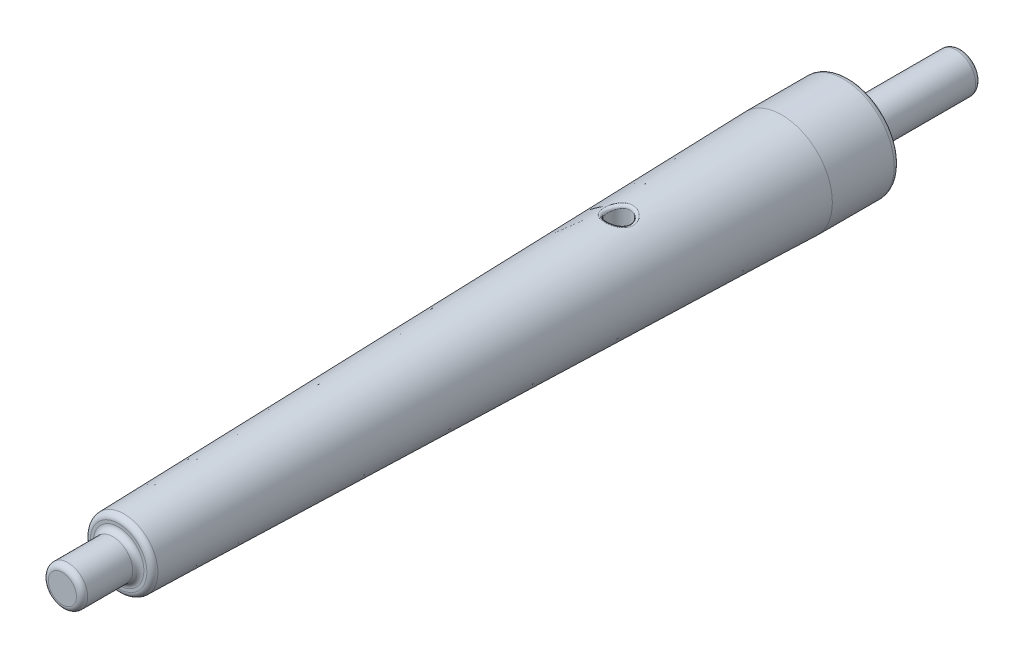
ISO-10303-21;
HEADER;
FILE_DESCRIPTION(('STEP AP214'),'2;1');
FILE_NAME('part.step','',(''),(''),'','','');
FILE_SCHEMA(('AUTOMOTIVE_DESIGN { 1 0 10303 214 1 1 1 1 }'));
ENDSEC;
DATA;
#1=APPLICATION_CONTEXT('core data for automotive mechanical design processes');
#2=APPLICATION_PROTOCOL_DEFINITION('international standard','automotive_design',2000,#1);
#3=PRODUCT_CONTEXT('',#1,'mechanical');
#4=PRODUCT('Part','Part','',(#3));
#5=PRODUCT_RELATED_PRODUCT_CATEGORY('part','',(#4));
#6=PRODUCT_DEFINITION_FORMATION('','',#4);
#7=PRODUCT_DEFINITION_CONTEXT('part definition',#1,'design');
#8=PRODUCT_DEFINITION('design','',#6,#7);
#9=PRODUCT_DEFINITION_SHAPE('','',#8);
#10=(LENGTH_UNIT() NAMED_UNIT(*) SI_UNIT(.MILLI.,.METRE.));
#11=(NAMED_UNIT(*) PLANE_ANGLE_UNIT() SI_UNIT($,.RADIAN.));
#12=(NAMED_UNIT(*) SI_UNIT($,.STERADIAN.) SOLID_ANGLE_UNIT());
#13=UNCERTAINTY_MEASURE_WITH_UNIT(LENGTH_MEASURE(1.E-05),#10,'distance_accuracy_value','');
#14=(GEOMETRIC_REPRESENTATION_CONTEXT(3) GLOBAL_UNCERTAINTY_ASSIGNED_CONTEXT((#13)) GLOBAL_UNIT_ASSIGNED_CONTEXT((#10,
#11,#12)) REPRESENTATION_CONTEXT('',''));
#15=CARTESIAN_POINT('',(0.,0.,0.));
#16=DIRECTION('',(0.,0.,1.));
#17=DIRECTION('',(1.,0.,0.));
#18=AXIS2_PLACEMENT_3D('',#15,#16,#17);
#19=CARTESIAN_POINT('',(0.,0.,40.));
#20=DIRECTION('',(0.,0.,-1.));
#21=DIRECTION('',(-1.,0.,0.));
#22=AXIS2_PLACEMENT_3D('',#19,#20,#21);
#23=PLANE('',#22);
#24=CARTESIAN_POINT('',(0.,0.,40.));
#25=DIRECTION('',(0.,0.,-1.));
#26=DIRECTION('',(-1.,0.,0.));
#27=AXIS2_PLACEMENT_3D('',#24,#25,#26);
#28=CIRCLE('',#27,1.25);
#29=CARTESIAN_POINT('',(-1.25,0.,40.));
#30=VERTEX_POINT('',#29);
#31=EDGE_CURVE('E114',#30,#30,#28,.F.);
#32=ORIENTED_EDGE('',*,*,#31,.T.);
#33=EDGE_LOOP('',(#32));
#34=FACE_BOUND('',#33,.T.);
#35=ADVANCED_FACE('F29',(#34),#23,.F.);
#36=CARTESIAN_POINT('',(0.,0.,40.));
#37=DIRECTION('',(0.,0.,1.));
#38=DIRECTION('',(1.,0.,0.));
#39=AXIS2_PLACEMENT_3D('',#36,#37,#38);
#40=CYLINDRICAL_SURFACE('',#39,1.75);
#41=CARTESIAN_POINT('',(0.,0.,35.5));
#42=DIRECTION('',(0.,0.,-1.));
#43=DIRECTION('',(-1.,0.,0.));
#44=AXIS2_PLACEMENT_3D('',#41,#42,#43);
#45=CIRCLE('',#44,1.75);
#46=CARTESIAN_POINT('',(-1.75,0.,35.5));
#47=VERTEX_POINT('',#46);
#48=EDGE_CURVE('E123',#47,#47,#45,.F.);
#49=ORIENTED_EDGE('',*,*,#48,.T.);
#50=EDGE_LOOP('',(#49));
#51=FACE_BOUND('',#50,.T.);
#52=CARTESIAN_POINT('',(0.,0.,39.5));
#53=DIRECTION('',(0.,0.,-1.));
#54=DIRECTION('',(-1.,0.,0.));
#55=AXIS2_PLACEMENT_3D('',#52,#53,#54);
#56=CIRCLE('',#55,1.75);
#57=CARTESIAN_POINT('',(-1.75,0.,39.5));
#58=VERTEX_POINT('',#57);
#59=EDGE_CURVE('E126',#58,#58,#56,.T.);
#60=ORIENTED_EDGE('',*,*,#59,.T.);
#61=EDGE_LOOP('',(#60));
#62=FACE_BOUND('',#61,.T.);
#63=ADVANCED_FACE('F158',(#51,#62),#40,.T.);
#64=CARTESIAN_POINT('',(0.,1.75,35.));
#65=DIRECTION('',(0.,0.,-1.));
#66=DIRECTION('',(-1.,0.,0.));
#67=AXIS2_PLACEMENT_3D('',#64,#65,#66);
#68=PLANE('',#67);
#69=CARTESIAN_POINT('',(0.,0.,35.));
#70=DIRECTION('',(0.,0.,-1.));
#71=DIRECTION('',(-1.,0.,0.));
#72=AXIS2_PLACEMENT_3D('',#69,#70,#71);
#73=CIRCLE('',#72,2.25);
#74=CARTESIAN_POINT('',(-2.25,0.,35.));
#75=VERTEX_POINT('',#74);
#76=EDGE_CURVE('E117',#75,#75,#73,.T.);
#77=ORIENTED_EDGE('',*,*,#76,.T.);
#78=EDGE_LOOP('',(#77));
#79=FACE_BOUND('',#78,.T.);
#80=CARTESIAN_POINT('',(0.,0.,35.));
#81=DIRECTION('',(0.,0.,-1.));
#82=DIRECTION('',(-1.,0.,0.));
#83=AXIS2_PLACEMENT_3D('',#80,#81,#82);
#84=CIRCLE('',#83,2.51255029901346);
#85=CARTESIAN_POINT('',(-2.51255029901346,0.,35.));
#86=VERTEX_POINT('',#85);
#87=EDGE_CURVE('E120',#86,#86,#84,.F.);
#88=ORIENTED_EDGE('',*,*,#87,.T.);
#89=EDGE_LOOP('',(#88));
#90=FACE_BOUND('',#89,.T.);
#91=ADVANCED_FACE('F82',(#79,#90),#68,.F.);
#92=CARTESIAN_POINT('',(0.,0.,-24.));
#93=DIRECTION('',(0.,0.,-1.));
#94=DIRECTION('',(-1.,0.,0.));
#95=AXIS2_PLACEMENT_3D('',#92,#93,#94);
#96=CONICAL_SURFACE('',#95,4.5,0.0254182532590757);
#97=CARTESIAN_POINT('',(-0.286505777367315,-3.89529391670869,-10.4580785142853));
#98=CARTESIAN_POINT('',(-0.30929535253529,-4.14463031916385,-10.451263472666));
#99=CARTESIAN_POINT('',(-0.381013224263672,-4.14416353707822,-10.6912442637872));
#100=CARTESIAN_POINT('',(-0.337468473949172,-3.88895133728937,-10.4428392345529));
#101=CARTESIAN_POINT('',(-0.364104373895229,-4.14032022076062,-10.4335483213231));
#102=CARTESIAN_POINT('',(-0.448789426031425,-4.13744654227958,-10.6721951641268));
#103=CARTESIAN_POINT('',(-0.387090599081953,-3.88104328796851,-10.4235590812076));
#104=CARTESIAN_POINT('',(-0.416908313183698,-4.13499968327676,-10.4112266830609));
#105=CARTESIAN_POINT('',(-0.5147851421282,-4.12907209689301,-10.6480949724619));
#106=CARTESIAN_POINT('',(-0.482497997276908,-3.862827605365,-10.3775005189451));
#107=CARTESIAN_POINT('',(-0.517113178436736,-4.123073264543,-10.3586935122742));
#108=CARTESIAN_POINT('',(-0.641680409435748,-4.10978472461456,-10.5905217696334));
#109=CARTESIAN_POINT('',(-0.528277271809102,-3.85251631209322,-10.3507106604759));
#110=CARTESIAN_POINT('',(-0.564626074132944,-4.11642281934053,-10.3282495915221));
#111=CARTESIAN_POINT('',(-0.702571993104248,-4.09886792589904,-10.5570344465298));
#112=CARTESIAN_POINT('',(-0.616708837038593,-3.82996638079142,-10.2891099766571));
#113=CARTESIAN_POINT('',(-0.654890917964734,-4.10236199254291,-10.2594776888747));
#114=CARTESIAN_POINT('',(-0.82020459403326,-4.07499877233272,-10.4800335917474));
#115=CARTESIAN_POINT('',(-0.659149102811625,-3.81766499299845,-10.2540095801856));
#116=CARTESIAN_POINT('',(-0.69732139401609,-4.0949064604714,-10.2206645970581));
#117=CARTESIAN_POINT('',(-0.876663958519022,-4.06198019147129,-10.4361580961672));
#118=CARTESIAN_POINT('',(-0.737681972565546,-3.79264544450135,-10.1773753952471));
#119=CARTESIAN_POINT('',(-0.774119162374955,-4.08038297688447,-10.1378269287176));
#120=CARTESIAN_POINT('',(-0.981149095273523,-4.03551095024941,-10.3403653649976));
#121=CARTESIAN_POINT('',(-0.773772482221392,-3.77992714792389,-10.1358394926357));
#122=CARTESIAN_POINT('',(-0.808348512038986,-4.07331566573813,-10.0936399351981));
#123=CARTESIAN_POINT('',(-1.02917208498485,-4.02206014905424,-10.2884454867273));
#124=CARTESIAN_POINT('',(-0.840027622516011,-3.7548039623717,-10.045538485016));
#125=CARTESIAN_POINT('',(-0.869590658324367,-4.06001567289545,-10.0000088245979));
#126=CARTESIAN_POINT('',(-1.11734562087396,-3.99550470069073,-10.1755692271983));
#127=CARTESIAN_POINT('',(-0.86989815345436,-3.74243185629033,-9.99655097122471));
#128=CARTESIAN_POINT('',(-0.89598224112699,-4.05386964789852,-9.95044149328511));
#129=CARTESIAN_POINT('',(-1.15710533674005,-3.98243531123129,-10.1143348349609));
#130=CARTESIAN_POINT('',(-0.920885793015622,-3.71991235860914,-9.89400664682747));
#131=CARTESIAN_POINT('',(-0.939744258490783,-4.04321111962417,-9.84960643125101));
#132=CARTESIAN_POINT('',(-1.22498898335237,-3.95867128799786,-9.98615442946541));
#133=CARTESIAN_POINT('',(-0.94201785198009,-3.70976118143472,-9.84045783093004));
#134=CARTESIAN_POINT('',(-0.956845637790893,-4.03875290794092,-9.79851027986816));
#135=CARTESIAN_POINT('',(-1.25313278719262,-3.94797261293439,-9.91921840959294));
#136=CARTESIAN_POINT('',(-0.974518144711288,-3.69296608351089,-9.73128606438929));
#137=CARTESIAN_POINT('',(-0.982441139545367,-4.03153931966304,-9.69684212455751));
#138=CARTESIAN_POINT('',(-1.29643659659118,-3.93031063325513,-9.78275370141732));
#139=CARTESIAN_POINT('',(-0.986069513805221,-3.68625736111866,-9.67572428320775));
#140=CARTESIAN_POINT('',(-0.990882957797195,-4.02880127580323,-9.64659856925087));
#141=CARTESIAN_POINT('',(-1.31184011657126,-3.92327826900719,-9.71330147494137));
#142=CARTESIAN_POINT('',(-0.999602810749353,-3.6767837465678,-9.56324312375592));
#143=CARTESIAN_POINT('',(-1.00035050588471,-4.02468637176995,-9.54606523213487));
#144=CARTESIAN_POINT('',(-1.32991840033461,-3.91341313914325,-9.57270002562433));
#145=CARTESIAN_POINT('',(-1.00158845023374,-3.67401732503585,-9.50632428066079));
#146=CARTESIAN_POINT('',(-1.00127373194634,-4.02333869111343,-9.49621343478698));
#147=CARTESIAN_POINT('',(-1.33259810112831,-3.91057874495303,-9.50155147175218));
#148=CARTESIAN_POINT('',(-0.996018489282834,-3.67267360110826,-9.39582590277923));
#149=CARTESIAN_POINT('',(-0.995985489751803,-4.0219361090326,-9.39884364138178));
#150=CARTESIAN_POINT('',(-1.3252599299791,-3.90936264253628,-9.36342849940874));
#151=CARTESIAN_POINT('',(-0.988940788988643,-3.67389132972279,-9.3422231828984));
#152=CARTESIAN_POINT('',(-0.990156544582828,-4.02182482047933,-9.35174305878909));
#153=CARTESIAN_POINT('',(-1.31587795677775,-3.91076279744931,-9.29642509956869));
#154=CARTESIAN_POINT('',(-0.9662893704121,-3.67977639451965,-9.23697398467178));
#155=CARTESIAN_POINT('',(-0.971509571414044,-4.02285574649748,-9.25739016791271));
#156=CARTESIAN_POINT('',(-1.28580539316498,-3.91723219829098,-9.16486360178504));
#157=CARTESIAN_POINT('',(-0.950715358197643,-3.68444385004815,-9.18532757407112));
#158=CARTESIAN_POINT('',(-0.95881776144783,-4.02398392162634,-9.21048976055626));
#159=CARTESIAN_POINT('',(-1.26511441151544,-3.92230157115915,-9.10030558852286));
#160=CARTESIAN_POINT('',(-0.911639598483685,-3.69652228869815,-9.08554004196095));
#161=CARTESIAN_POINT('',(-0.925823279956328,-4.02765755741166,-9.11736562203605));
#162=CARTESIAN_POINT('',(-1.21317673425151,-3.93535540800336,-8.97557117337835));
#163=CARTESIAN_POINT('',(-0.888161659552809,-3.70392503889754,-9.03738891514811));
#164=CARTESIAN_POINT('',(-0.90574372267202,-4.03016834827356,-9.07138948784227));
#165=CARTESIAN_POINT('',(-1.18196173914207,-3.94333112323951,-8.91538226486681));
#166=CARTESIAN_POINT('',(-0.833899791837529,-3.72054954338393,-8.94550520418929));
#167=CARTESIAN_POINT('',(-0.857483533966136,-4.0365754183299,-8.98128025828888));
#168=CARTESIAN_POINT('',(-1.10980125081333,-3.96121191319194,-8.8005276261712));
#169=CARTESIAN_POINT('',(-0.803101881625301,-3.72977477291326,-8.90178130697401));
#170=CARTESIAN_POINT('',(-0.82950940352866,-4.04043922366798,-8.93725581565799));
#171=CARTESIAN_POINT('',(-1.06883713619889,-3.97112067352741,-8.74587275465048));
#172=CARTESIAN_POINT('',(-0.73347048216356,-3.74940046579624,-8.81800345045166));
#173=CARTESIAN_POINT('',(-0.764112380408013,-4.0493850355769,-8.85108105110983));
#174=CARTESIAN_POINT('',(-0.976206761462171,-3.9921836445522,-8.6411504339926));
#175=CARTESIAN_POINT('',(-0.694337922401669,-3.75983512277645,-8.77820294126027));
#176=CARTESIAN_POINT('',(-0.726496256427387,-4.05449168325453,-8.80902141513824));
#177=CARTESIAN_POINT('',(-0.924142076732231,-4.00337382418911,-8.59139979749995));
#178=CARTESIAN_POINT('',(-0.610038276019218,-3.78026111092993,-8.70568270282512));
#179=CARTESIAN_POINT('',(-0.643278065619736,-4.0650771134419,-8.73119124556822));
#180=CARTESIAN_POINT('',(-0.811971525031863,-4.02526922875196,-8.50074949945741));
#181=CARTESIAN_POINT('',(-0.564881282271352,-3.79025314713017,-8.67295136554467));
#182=CARTESIAN_POINT('',(-0.597790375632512,-4.07055498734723,-8.69523613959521));
#183=CARTESIAN_POINT('',(-0.751879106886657,-4.0359752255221,-8.45983532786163));
#184=CARTESIAN_POINT('',(-0.468566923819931,-3.80886226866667,-8.61474428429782));
#185=CARTESIAN_POINT('',(-0.499066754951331,-4.08110525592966,-8.63077163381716));
#186=CARTESIAN_POINT('',(-0.623699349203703,-4.05590931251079,-8.38707647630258));
#187=CARTESIAN_POINT('',(-0.417301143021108,-3.8174450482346,-8.58944026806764));
#188=CARTESIAN_POINT('',(-0.445617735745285,-4.08619536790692,-8.60217433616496));
#189=CARTESIAN_POINT('',(-0.555467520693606,-4.06510054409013,-8.35544645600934));
#190=CARTESIAN_POINT('',(-0.310996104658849,-3.83192750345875,-8.54787803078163));
#191=CARTESIAN_POINT('',(-0.33368120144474,-4.0949232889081,-8.55510657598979));
#192=CARTESIAN_POINT('',(-0.413974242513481,-4.08060780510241,-8.30349365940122));
#193=CARTESIAN_POINT('',(-0.255957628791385,-3.83782773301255,-8.53161794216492));
#194=CARTESIAN_POINT('',(-0.274984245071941,-4.09860129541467,-8.53638965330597));
#195=CARTESIAN_POINT('',(-0.340713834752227,-4.08692442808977,-8.28316854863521));
#196=CARTESIAN_POINT('',(-0.14546168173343,-3.84609093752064,-8.50907974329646));
#197=CARTESIAN_POINT('',(-0.156753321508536,-4.10376257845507,-8.51052534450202));
#198=CARTESIAN_POINT('',(-0.193631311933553,-4.09577040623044,-8.25499580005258));
#199=CARTESIAN_POINT('',(-0.0900681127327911,-3.84855624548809,-8.50251249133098));
#200=CARTESIAN_POINT('',(-0.0970009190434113,-4.10533736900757,-8.50289837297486));
#201=CARTESIAN_POINT('',(-0.119894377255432,-4.09840932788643,-8.24678673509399));
#202=CARTESIAN_POINT('',(0.0210554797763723,-3.84998927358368,-8.49867854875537));
#203=CARTESIAN_POINT('',(0.0226227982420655,-4.10624432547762,-8.49847809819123));
#204=CARTESIAN_POINT('',(0.0280280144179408,-4.09994330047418,-8.24199430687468));
#205=CARTESIAN_POINT('',(0.0767853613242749,-3.84895837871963,-8.50140817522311));
#206=CARTESIAN_POINT('',(0.0828511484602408,-4.10558283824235,-8.50165401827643));
#207=CARTESIAN_POINT('',(0.102213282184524,-4.09883983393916,-8.2454063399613));
#208=CARTESIAN_POINT('',(0.181589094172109,-3.84379104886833,-8.51534430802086));
#209=CARTESIAN_POINT('',(0.195362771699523,-4.10233133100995,-8.51768532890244));
#210=CARTESIAN_POINT('',(0.241721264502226,-4.09330832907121,-8.26282650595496));
#211=CARTESIAN_POINT('',(0.230787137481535,-3.83996320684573,-8.52570926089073));
#212=CARTESIAN_POINT('',(0.248135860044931,-4.09991732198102,-8.5296578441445));
#213=CARTESIAN_POINT('',(0.307209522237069,-4.08921064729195,-8.27578269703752));
#214=CARTESIAN_POINT('',(0.326942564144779,-3.82992971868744,-8.55363002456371));
#215=CARTESIAN_POINT('',(0.350369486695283,-4.09373712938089,-8.56153164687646));
#216=CARTESIAN_POINT('',(0.435199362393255,-4.07846862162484,-8.31068365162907));
#217=CARTESIAN_POINT('',(0.373899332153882,-3.8237234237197,-8.57118779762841));
#218=CARTESIAN_POINT('',(0.400018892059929,-4.08994533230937,-8.58157376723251));
#219=CARTESIAN_POINT('',(0.497700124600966,-4.07182358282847,-8.33263086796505));
#220=CARTESIAN_POINT('',(0.470730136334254,-3.80853851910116,-8.61590092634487));
#221=CARTESIAN_POINT('',(0.501243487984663,-4.08095090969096,-8.63192045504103));
#222=CARTESIAN_POINT('',(0.6265782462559,-4.05556225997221,-8.38852227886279));
#223=CARTESIAN_POINT('',(0.520125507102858,-3.79929691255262,-8.64404016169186));
#224=CARTESIAN_POINT('',(0.552198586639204,-4.07559985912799,-8.66344414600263));
#225=CARTESIAN_POINT('',(0.692317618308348,-4.04566398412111,-8.4236963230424));
#226=CARTESIAN_POINT('',(0.613365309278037,-3.77958417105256,-8.70817387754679));
#227=CARTESIAN_POINT('',(0.64665061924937,-4.06473059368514,-8.73377899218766));
#228=CARTESIAN_POINT('',(0.81639882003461,-4.02454342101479,-8.50386346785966));
#229=CARTESIAN_POINT('',(0.657206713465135,-3.76911237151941,-8.74417261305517));
#230=CARTESIAN_POINT('',(0.690134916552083,-4.05919379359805,-8.77283168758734));
#231=CARTESIAN_POINT('',(0.874736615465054,-4.01332041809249,-8.54886188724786));
#232=CARTESIAN_POINT('',(0.738180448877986,-3.74820055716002,-8.82303477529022));
#233=CARTESIAN_POINT('',(0.768721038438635,-4.04880694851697,-8.85625964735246));
#234=CARTESIAN_POINT('',(0.982473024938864,-3.99089599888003,-8.64743959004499));
#235=CARTESIAN_POINT('',(0.775315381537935,-3.73776053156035,-8.86589552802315));
#236=CARTESIAN_POINT('',(0.803672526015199,-4.04396794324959,-8.90077349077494));
#237=CARTESIAN_POINT('',(1.0318751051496,-3.97969457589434,-8.70101553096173));
#238=CARTESIAN_POINT('',(0.841888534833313,-3.71821253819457,-8.95739231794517));
#239=CARTESIAN_POINT('',(0.864889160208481,-4.03558697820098,-8.99318398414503));
#240=CARTESIAN_POINT('',(1.12042664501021,-3.9587001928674,-8.81538651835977));
#241=CARTESIAN_POINT('',(0.871328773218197,-3.70910422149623,-9.00602683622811));
#242=CARTESIAN_POINT('',(0.890909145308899,-4.03208085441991,-9.04105807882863));
#243=CARTESIAN_POINT('',(1.15957879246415,-3.94890686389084,-8.87617966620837));
#244=CARTESIAN_POINT('',(0.921568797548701,-3.69346766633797,-9.10767844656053));
#245=CARTESIAN_POINT('',(0.934469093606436,-4.02661748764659,-9.13843633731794));
#246=CARTESIAN_POINT('',(1.22637681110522,-3.93205997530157,-9.00324417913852));
#247=CARTESIAN_POINT('',(0.942389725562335,-3.68693311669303,-9.16068442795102));
#248=CARTESIAN_POINT('',(0.951769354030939,-4.02469797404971,-9.18772982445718));
#249=CARTESIAN_POINT('',(1.25405083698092,-3.92499971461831,-9.06950165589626));
#250=CARTESIAN_POINT('',(0.974763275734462,-3.67740791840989,-9.26964516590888));
#251=CARTESIAN_POINT('',(0.978587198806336,-4.02230906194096,-9.28709020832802));
#252=CARTESIAN_POINT('',(1.2970604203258,-3.91464722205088,-9.20570257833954));
#253=CARTESIAN_POINT('',(0.986319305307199,-3.67441596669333,-9.32559883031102));
#254=CARTESIAN_POINT('',(0.987910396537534,-4.02186602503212,-9.33679078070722));
#255=CARTESIAN_POINT('',(1.31240051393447,-3.91135360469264,-9.27564465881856));
#256=CARTESIAN_POINT('',(0.999441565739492,-3.67258185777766,-9.43615720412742));
#257=CARTESIAN_POINT('',(0.999001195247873,-4.02226133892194,-9.43457009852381));
#258=CARTESIAN_POINT('',(1.3297880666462,-3.90918673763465,-9.41384262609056));
#259=CARTESIAN_POINT('',(1.00143254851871,-3.67355962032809,-9.49070988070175));
#260=CARTESIAN_POINT('',(1.00101682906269,-4.02304622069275,-9.48222413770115));
#261=CARTESIAN_POINT('',(1.33240078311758,-3.91012188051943,-9.48203347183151));
#262=CARTESIAN_POINT('',(0.996541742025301,-3.67928000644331,-9.59928308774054));
#263=CARTESIAN_POINT('',(0.998282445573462,-4.02583288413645,-9.57827185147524));
#264=CARTESIAN_POINT('',(1.32582234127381,-3.91600017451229,-9.61774998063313));
#265=CARTESIAN_POINT('',(0.989660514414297,-3.68402239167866,-9.65330365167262));
#266=CARTESIAN_POINT('',(0.993574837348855,-4.02781747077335,-9.62626171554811));
#267=CARTESIAN_POINT('',(1.31663193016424,-3.92094307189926,-9.68527568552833));
#268=CARTESIAN_POINT('',(0.967522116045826,-3.69670874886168,-9.75832362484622));
#269=CARTESIAN_POINT('',(0.976929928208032,-4.0331670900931,-9.72192254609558));
#270=CARTESIAN_POINT('',(1.28711255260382,-3.9342412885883,-9.81655065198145));
#271=CARTESIAN_POINT('',(0.952415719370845,-3.70459442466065,-9.80935963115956));
#272=CARTESIAN_POINT('',(0.96526505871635,-4.03647196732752,-9.76924430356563));
#273=CARTESIAN_POINT('',(1.26698410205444,-3.94253450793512,-9.8803456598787));
#274=CARTESIAN_POINT('',(0.914418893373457,-3.72280935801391,-9.90822558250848));
#275=CARTESIAN_POINT('',(0.934116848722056,-4.0445989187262,-9.86355140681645));
#276=CARTESIAN_POINT('',(1.2163782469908,-3.96172643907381,-10.0039280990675));
#277=CARTESIAN_POINT('',(0.891516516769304,-3.73314235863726,-9.95605047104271));
#278=CARTESIAN_POINT('',(0.914829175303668,-4.04937813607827,-9.91032071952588));
#279=CARTESIAN_POINT('',(1.18588495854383,-3.97262914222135,-10.0637092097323));
#280=CARTESIAN_POINT('',(0.837483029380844,-3.75572887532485,-10.0492183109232));
#281=CARTESIAN_POINT('',(0.867103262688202,-4.06052668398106,-10.0037866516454));
#282=CARTESIAN_POINT('',(1.11395912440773,-3.9964816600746,-10.1801690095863));
#283=CARTESIAN_POINT('',(0.806051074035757,-3.76804409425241,-10.0943771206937));
#284=CARTESIAN_POINT('',(0.838546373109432,-4.06691288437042,-10.0503591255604));
#285=CARTESIAN_POINT('',(1.07212671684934,-4.00949743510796,-10.2366175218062));
#286=CARTESIAN_POINT('',(0.736260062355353,-3.79305962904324,-10.1789163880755));
#287=CARTESIAN_POINT('',(0.772673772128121,-4.08061303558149,-10.1393639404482));
#288=CARTESIAN_POINT('',(0.97925716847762,-4.03594863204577,-10.3422916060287));
#289=CARTESIAN_POINT('',(0.697898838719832,-3.80576006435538,-10.2182950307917));
#290=CARTESIAN_POINT('',(0.735555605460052,-4.0879050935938,-10.1818723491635));
#291=CARTESIAN_POINT('',(0.928217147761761,-4.04938418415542,-10.3915149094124));
#292=CARTESIAN_POINT('',(0.613446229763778,-3.83083813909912,-10.2917973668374));
#293=CARTESIAN_POINT('',(0.651648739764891,-4.10285632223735,-10.262264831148));
#294=CARTESIAN_POINT('',(0.815864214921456,-4.07592100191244,-10.4833928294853));
#295=CARTESIAN_POINT('',(0.567102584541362,-3.84318125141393,-10.3256397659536));
#296=CARTESIAN_POINT('',(0.604590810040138,-4.11053732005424,-10.3001390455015));
#297=CARTESIAN_POINT('',(0.754216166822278,-4.08898603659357,-10.5256958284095));
#298=CARTESIAN_POINT('',(0.469135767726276,-3.86566652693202,-10.3849771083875));
#299=CARTESIAN_POINT('',(0.503324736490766,-4.12486329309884,-10.3670078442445));
#300=CARTESIAN_POINT('',(0.623907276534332,-4.11279018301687,-10.5998675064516));
#301=CARTESIAN_POINT('',(0.417521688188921,-3.87581238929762,-10.4104861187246));
#302=CARTESIAN_POINT('',(0.449069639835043,-4.13155482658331,-10.3962985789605));
#303=CARTESIAN_POINT('',(0.555258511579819,-4.1235332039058,-10.6317537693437));
#304=CARTESIAN_POINT('',(0.311411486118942,-3.89267264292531,-10.4519471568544));
#305=CARTESIAN_POINT('',(0.33645630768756,-4.14279144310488,-10.4439615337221));
#306=CARTESIAN_POINT('',(0.414134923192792,-4.14138726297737,-10.6835800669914));
#307=CARTESIAN_POINT('',(0.256990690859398,-3.89944978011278,-10.4680749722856));
#308=CARTESIAN_POINT('',(0.277996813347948,-4.14742765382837,-10.4627777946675));
#309=CARTESIAN_POINT('',(0.341760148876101,-4.14856471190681,-10.7037398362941));
#310=CARTESIAN_POINT('',(0.145998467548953,-3.90912489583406,-10.4909042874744));
#311=CARTESIAN_POINT('',(0.15841773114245,-4.15404536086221,-10.4893182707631));
#312=CARTESIAN_POINT('',(0.194154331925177,-4.15881161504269,-10.7322764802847));
#313=CARTESIAN_POINT('',(0.0894278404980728,-3.91202430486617,-10.4976092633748));
#314=CARTESIAN_POINT('',(0.0969666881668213,-4.156066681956,-10.4972056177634));
#315=CARTESIAN_POINT('',(0.11892435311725,-4.16188258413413,-10.7406577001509));
#316=CARTESIAN_POINT('',(-0.0212416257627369,-3.91358504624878,-10.5012300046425));
#317=CARTESIAN_POINT('',(-0.0229832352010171,-4.1571460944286,-10.5014360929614));
#318=CARTESIAN_POINT('',(-0.0282479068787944,-4.16353565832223,-10.7451836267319));
#319=CARTESIAN_POINT('',(-0.0753238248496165,-3.9124495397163,-10.4986150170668));
#320=CARTESIAN_POINT('',(-0.0818152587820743,-4.15635260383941,-10.4983574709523));
#321=CARTESIAN_POINT('',(-0.100168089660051,-4.16233294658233,-10.7419148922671));
#322=CARTESIAN_POINT('',(-0.182228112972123,-3.90650585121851,-10.4847324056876));
#323=CARTESIAN_POINT('',(-0.19741436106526,-4.15226072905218,-10.4821723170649));
#324=CARTESIAN_POINT('',(-0.242334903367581,-4.15603777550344,-10.7245616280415));
#325=CARTESIAN_POINT('',(-0.235050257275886,-3.90169783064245,-10.473465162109));
#326=CARTESIAN_POINT('',(-0.254495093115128,-4.14893972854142,-10.4689757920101));
#327=CARTESIAN_POINT('',(-0.312581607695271,-4.15094548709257,-10.7104775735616));
#328=CARTESIAN_POINT('',(-0.286505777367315,-3.89529391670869,-10.4580785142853));
#329=CARTESIAN_POINT('',(-0.30929535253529,-4.14463031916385,-10.451263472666));
#330=CARTESIAN_POINT('',(-0.381013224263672,-4.14416353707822,-10.6912442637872));
#331=(BOUNDED_SURFACE() B_SPLINE_SURFACE(3,2,((#97,#98,#99),(#100,#101,#102),(#103,#104,#105),
(#106,#107,#108),(#109,#110,#111),(#112,#113,#114),(#115,#116,#117),(#118,#119,#120),(#121,#122,
#123),(#124,#125,#126),(#127,#128,#129),(#130,#131,#132),(#133,#134,#135),(#136,#137,#138),
(#139,#140,#141),(#142,#143,#144),(#145,#146,#147),(#148,#149,#150),(#151,#152,#153),(#154,#155,
#156),(#157,#158,#159),(#160,#161,#162),(#163,#164,#165),(#166,#167,#168),(#169,#170,#171),
(#172,#173,#174),(#175,#176,#177),(#178,#179,#180),(#181,#182,#183),(#184,#185,#186),(#187,#188,
#189),(#190,#191,#192),(#193,#194,#195),(#196,#197,#198),(#199,#200,#201),(#202,#203,#204),
(#205,#206,#207),(#208,#209,#210),(#211,#212,#213),(#214,#215,#216),(#217,#218,#219),(#220,#221,
#222),(#223,#224,#225),(#226,#227,#228),(#229,#230,#231),(#232,#233,#234),(#235,#236,#237),
(#238,#239,#240),(#241,#242,#243),(#244,#245,#246),(#247,#248,#249),(#250,#251,#252),(#253,#254,
#255),(#256,#257,#258),(#259,#260,#261),(#262,#263,#264),(#265,#266,#267),(#268,#269,#270),
(#271,#272,#273),(#274,#275,#276),(#277,#278,#279),(#280,#281,#282),(#283,#284,#285),(#286,#287,
#288),(#289,#290,#291),(#292,#293,#294),(#295,#296,#297),(#298,#299,#300),(#301,#302,#303),
(#304,#305,#306),(#307,#308,#309),(#310,#311,#312),(#313,#314,#315),(#316,#317,#318),(#319,#320,
#321),(#322,#323,#324),(#325,#326,#327),(#328,#329,#330)),.UNSPECIFIED.,.T.,.F.,
.F.) B_SPLINE_SURFACE_WITH_KNOTS((4,2,2,2,2,2,2,2,2,2,2,2,2,2,2,2,2,2,2,2,2,2,2,2,2,2,2,2,2,2,2,
2,2,2,2,2,2,2,4),(3,3),(0.,0.200146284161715,0.400599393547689,0.609469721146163,
0.818408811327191,1.03568933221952,1.25259656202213,1.46525526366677,1.67783144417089,
1.87964677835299,2.08146909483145,2.28268883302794,2.48429604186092,2.69496926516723,
2.90529387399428,3.12015508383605,3.33497190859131,3.54324118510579,3.7514279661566,
3.93956829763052,4.12775998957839,4.34167710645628,4.55571032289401,4.76966033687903,
4.98355419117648,5.19692023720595,5.41020777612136,5.61393044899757,5.81764022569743,
6.01773573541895,6.2181392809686,6.42682145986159,6.6355690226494,6.8528665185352,
7.06979529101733,7.28251608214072,7.49515837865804,7.69724901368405,7.89933076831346),(0.,1.),
.UNSPECIFIED.) GEOMETRIC_REPRESENTATION_ITEM() RATIONAL_B_SPLINE_SURFACE(((1.,0.706444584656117,
1.),(1.,0.703005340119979,1.),(1.,0.698702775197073,1.),(1.,0.688718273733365,1.),(1.,
0.683034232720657,1.),(1.,0.670496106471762,1.),(1.,0.663602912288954,1.),(1.,0.649454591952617,
1.),(1.,0.642199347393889,1.),(1.,0.627761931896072,1.),(1.,0.620594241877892,1.),(1.,
0.607521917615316,1.),(1.,0.601615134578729,1.),(1.,0.591960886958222,1.),(1.,0.588173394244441,
1.),(1.,0.583140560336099,1.),(1.,0.581894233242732,1.),(1.,0.582101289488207,1.),(1.,
0.583421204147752,1.),(1.,0.588260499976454,1.),(1.,0.591779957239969,1.),(1.,0.600473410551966,
1.),(1.,0.605642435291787,1.),(1.,0.616967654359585,1.),(1.,0.623125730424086,1.),(1.,
0.635994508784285,1.),(1.,0.642717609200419,1.),(1.,0.655692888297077,1.),(1.,0.661945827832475,
1.),(1.,0.67347203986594,1.),(1.,0.678721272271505,1.),(1.,0.687520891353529,1.),(1.,
0.691071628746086,1.),(1.,0.696031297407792,1.),(1.,0.697502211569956,1.),(1.,0.698358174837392,
1.),(1.,0.697744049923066,1.),(1.,0.694651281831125,1.),(1.,0.692357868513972,1.),(1.,
0.686306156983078,1.),(1.,0.682547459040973,1.),(1.,0.67326610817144,1.),(1.,0.667572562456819,
1.),(1.,0.655262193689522,1.),(1.,0.648644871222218,1.),(1.,0.635214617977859,1.),(1.,
0.62840176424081,1.),(1.,0.61540002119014,1.),(1.,0.609210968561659,1.),(1.,0.598319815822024,
1.),(1.,0.59361408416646,1.),(1.,0.586415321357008,1.),(1.,0.583921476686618,1.),(1.,
0.581647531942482,1.),(1.,0.581750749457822,1.),(1.,0.584404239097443,1.),(1.,0.586954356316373,
1.),(1.,0.594089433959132,1.),(1.,0.59863748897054,1.),(1.,0.609196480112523,1.),(1.,
0.615209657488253,1.),(1.,0.62828922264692,1.),(1.,0.635388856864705,1.),(1.,0.649689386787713,
1.),(1.,0.65689031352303,1.),(1.,0.670987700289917,1.),(1.,0.677859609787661,1.),(1.,
0.690285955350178,1.),(1.,0.695842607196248,1.),(1.,0.705031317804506,1.),(1.,0.708698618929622,
1.),(1.,0.713923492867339,1.),(1.,0.715481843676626,1.),(1.,0.716321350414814,1.),(1.,
0.715711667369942,1.),(1.,0.712509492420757,1.),(1.,0.709917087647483,1.),(1.,0.706444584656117,1.))) REPRESENTATION_ITEM('') SURFACE());
#332=CARTESIAN_POINT('',(-0.381013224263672,-4.14416353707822,-10.6912442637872));
#333=CARTESIAN_POINT('',(-0.448789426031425,-4.13744654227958,-10.6721951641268));
#334=CARTESIAN_POINT('',(-0.5147851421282,-4.12907209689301,-10.6480949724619));
#335=CARTESIAN_POINT('',(-0.641680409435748,-4.10978472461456,-10.5905217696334));
#336=CARTESIAN_POINT('',(-0.702571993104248,-4.09886792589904,-10.5570344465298));
#337=CARTESIAN_POINT('',(-0.82020459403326,-4.07499877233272,-10.4800335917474));
#338=CARTESIAN_POINT('',(-0.876663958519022,-4.06198019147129,-10.4361580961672));
#339=CARTESIAN_POINT('',(-0.981149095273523,-4.03551095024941,-10.3403653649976));
#340=CARTESIAN_POINT('',(-1.02917208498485,-4.02206014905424,-10.2884454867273));
#341=CARTESIAN_POINT('',(-1.11734562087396,-3.99550470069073,-10.1755692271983));
#342=CARTESIAN_POINT('',(-1.15710533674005,-3.98243531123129,-10.1143348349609));
#343=CARTESIAN_POINT('',(-1.22498898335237,-3.95867128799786,-9.98615442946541));
#344=CARTESIAN_POINT('',(-1.25313278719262,-3.94797261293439,-9.91921840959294));
#345=CARTESIAN_POINT('',(-1.29643659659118,-3.93031063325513,-9.78275370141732));
#346=CARTESIAN_POINT('',(-1.31184011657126,-3.92327826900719,-9.71330147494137));
#347=CARTESIAN_POINT('',(-1.32991840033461,-3.91341313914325,-9.57270002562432));
#348=CARTESIAN_POINT('',(-1.33259810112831,-3.91057874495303,-9.50155147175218));
#349=CARTESIAN_POINT('',(-1.3252599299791,-3.90936264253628,-9.36342849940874));
#350=CARTESIAN_POINT('',(-1.31587795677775,-3.91076279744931,-9.29642509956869));
#351=CARTESIAN_POINT('',(-1.28580539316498,-3.91723219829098,-9.16486360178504));
#352=CARTESIAN_POINT('',(-1.26511441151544,-3.92230157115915,-9.10030558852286));
#353=CARTESIAN_POINT('',(-1.21317673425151,-3.93535540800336,-8.97557117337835));
#354=CARTESIAN_POINT('',(-1.18196173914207,-3.94333112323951,-8.91538226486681));
#355=CARTESIAN_POINT('',(-1.10980125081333,-3.96121191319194,-8.8005276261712));
#356=CARTESIAN_POINT('',(-1.06883713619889,-3.97112067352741,-8.74587275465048));
#357=CARTESIAN_POINT('',(-0.97620676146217,-3.9921836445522,-8.6411504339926));
#358=CARTESIAN_POINT('',(-0.924142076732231,-4.00337382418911,-8.59139979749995));
#359=CARTESIAN_POINT('',(-0.811971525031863,-4.02526922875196,-8.50074949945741));
#360=CARTESIAN_POINT('',(-0.751879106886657,-4.0359752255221,-8.45983532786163));
#361=CARTESIAN_POINT('',(-0.623699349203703,-4.05590931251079,-8.38707647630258));
#362=CARTESIAN_POINT('',(-0.555467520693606,-4.06510054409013,-8.35544645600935));
#363=CARTESIAN_POINT('',(-0.413974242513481,-4.08060780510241,-8.30349365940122));
#364=CARTESIAN_POINT('',(-0.340713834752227,-4.08692442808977,-8.28316854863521));
#365=CARTESIAN_POINT('',(-0.193631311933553,-4.09577040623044,-8.25499580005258));
#366=CARTESIAN_POINT('',(-0.119894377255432,-4.09840932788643,-8.24678673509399));
#367=CARTESIAN_POINT('',(0.0280280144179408,-4.09994330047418,-8.24199430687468));
#368=CARTESIAN_POINT('',(0.102213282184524,-4.09883983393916,-8.2454063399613));
#369=CARTESIAN_POINT('',(0.241721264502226,-4.09330832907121,-8.26282650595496));
#370=CARTESIAN_POINT('',(0.307209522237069,-4.08921064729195,-8.27578269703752));
#371=CARTESIAN_POINT('',(0.435199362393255,-4.07846862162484,-8.31068365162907));
#372=CARTESIAN_POINT('',(0.497700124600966,-4.07182358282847,-8.33263086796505));
#373=CARTESIAN_POINT('',(0.6265782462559,-4.05556225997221,-8.38852227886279));
#374=CARTESIAN_POINT('',(0.692317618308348,-4.04566398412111,-8.4236963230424));
#375=CARTESIAN_POINT('',(0.81639882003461,-4.02454342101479,-8.50386346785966));
#376=CARTESIAN_POINT('',(0.874736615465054,-4.01332041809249,-8.54886188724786));
#377=CARTESIAN_POINT('',(0.982473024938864,-3.99089599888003,-8.64743959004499));
#378=CARTESIAN_POINT('',(1.0318751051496,-3.97969457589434,-8.70101553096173));
#379=CARTESIAN_POINT('',(1.12042664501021,-3.9587001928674,-8.81538651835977));
#380=CARTESIAN_POINT('',(1.15957879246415,-3.94890686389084,-8.87617966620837));
#381=CARTESIAN_POINT('',(1.22637681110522,-3.93205997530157,-9.00324417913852));
#382=CARTESIAN_POINT('',(1.25405083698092,-3.92499971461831,-9.06950165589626));
#383=CARTESIAN_POINT('',(1.2970604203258,-3.91464722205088,-9.20570257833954));
#384=CARTESIAN_POINT('',(1.31240051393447,-3.91135360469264,-9.27564465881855));
#385=CARTESIAN_POINT('',(1.3297880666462,-3.90918673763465,-9.41384262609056));
#386=CARTESIAN_POINT('',(1.33240078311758,-3.91012188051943,-9.48203347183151));
#387=CARTESIAN_POINT('',(1.32582234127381,-3.91600017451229,-9.61774998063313));
#388=CARTESIAN_POINT('',(1.31663193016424,-3.92094307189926,-9.68527568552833));
#389=CARTESIAN_POINT('',(1.28711255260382,-3.9342412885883,-9.81655065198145));
#390=CARTESIAN_POINT('',(1.26698410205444,-3.94253450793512,-9.8803456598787));
#391=CARTESIAN_POINT('',(1.2163782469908,-3.96172643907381,-10.0039280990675));
#392=CARTESIAN_POINT('',(1.18588495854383,-3.97262914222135,-10.0637092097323));
#393=CARTESIAN_POINT('',(1.11395912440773,-3.9964816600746,-10.1801690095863));
#394=CARTESIAN_POINT('',(1.07212671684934,-4.00949743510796,-10.2366175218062));
#395=CARTESIAN_POINT('',(0.97925716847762,-4.03594863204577,-10.3422916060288));
#396=CARTESIAN_POINT('',(0.928217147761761,-4.04938418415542,-10.3915149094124));
#397=CARTESIAN_POINT('',(0.815864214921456,-4.07592100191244,-10.4833928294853));
#398=CARTESIAN_POINT('',(0.754216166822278,-4.08898603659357,-10.5256958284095));
#399=CARTESIAN_POINT('',(0.623907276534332,-4.11279018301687,-10.5998675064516));
#400=CARTESIAN_POINT('',(0.555258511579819,-4.1235332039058,-10.6317537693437));
#401=CARTESIAN_POINT('',(0.414134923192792,-4.14138726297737,-10.6835800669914));
#402=CARTESIAN_POINT('',(0.341760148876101,-4.14856471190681,-10.7037398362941));
#403=CARTESIAN_POINT('',(0.194154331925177,-4.15881161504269,-10.7322764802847));
#404=CARTESIAN_POINT('',(0.11892435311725,-4.16188258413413,-10.7406577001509));
#405=CARTESIAN_POINT('',(-0.0282479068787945,-4.16353565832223,-10.7451836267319));
#406=CARTESIAN_POINT('',(-0.100168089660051,-4.16233294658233,-10.7419148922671));
#407=CARTESIAN_POINT('',(-0.242334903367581,-4.15603777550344,-10.7245616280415));
#408=CARTESIAN_POINT('',(-0.312581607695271,-4.15094548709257,-10.7104775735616));
#409=CARTESIAN_POINT('',(-0.381013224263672,-4.14416353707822,-10.6912442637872));
#410=B_SPLINE_CURVE_WITH_KNOTS('',3,(#332,#333,#334,#335,#336,#337,#338,#339,#340,#341,#342,
#343,#344,#345,#346,#347,#348,#349,#350,#351,#352,#353,#354,#355,#356,#357,#358,#359,#360,#361,
#362,#363,#364,#365,#366,#367,#368,#369,#370,#371,#372,#373,#374,#375,#376,#377,#378,#379,#380,
#381,#382,#383,#384,#385,#386,#387,#388,#389,#390,#391,#392,#393,#394,#395,#396,#397,#398,#399,
#400,#401,#402,#403,#404,#405,#406,#407,#408,#409),.UNSPECIFIED.,.T.,.F.,(4,2,2,2,2,2,2,2,2,2,2,
2,2,2,2,2,2,2,2,2,2,2,2,2,2,2,2,2,2,2,2,2,2,2,2,2,2,2,4),(0.,0.200146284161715,
0.400599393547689,0.609469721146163,0.818408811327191,1.03568933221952,1.25259656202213,
1.46525526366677,1.67783144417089,1.87964677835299,2.08146909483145,2.28268883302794,
2.48429604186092,2.69496926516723,2.90529387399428,3.12015508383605,3.33497190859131,
3.54324118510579,3.7514279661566,3.93956829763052,4.12775998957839,4.34167710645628,
4.55571032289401,4.76966033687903,4.98355419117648,5.19692023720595,5.41020777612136,
5.61393044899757,5.81764022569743,6.01773573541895,6.2181392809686,6.42682145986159,
6.6355690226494,6.8528665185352,7.06979529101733,7.28251608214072,7.49515837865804,
7.69724901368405,7.89933076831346),.UNSPECIFIED.);
#411=CARTESIAN_POINT('',(-0.381013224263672,-4.14416353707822,-10.6912442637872));
#412=VERTEX_POINT('',#411);
#413=EDGE_CURVE('E44',#412,#412,#410,.T.);
#414=ORIENTED_EDGE('',*,*,#413,.T.);
#415=EDGE_LOOP('',(#414));
#416=FACE_BOUND('',#415,.T.);
#417=CARTESIAN_POINT('',(-0.769311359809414,3.78121193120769,-10.1388740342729));
#418=CARTESIAN_POINT('',(-0.803502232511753,4.07420097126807,-10.0977024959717));
#419=CARTESIAN_POINT('',(-1.02323789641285,4.02342099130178,-10.2922386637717));
#420=CARTESIAN_POINT('',(-0.733352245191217,3.7940626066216,-10.1821742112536));
#421=CARTESIAN_POINT('',(-0.769912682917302,4.08117108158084,-10.1428062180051));
#422=CARTESIAN_POINT('',(-0.975388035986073,4.03700940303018,-10.346363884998));
#423=CARTESIAN_POINT('',(-0.693748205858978,3.80710455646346,-10.222416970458));
#424=CARTESIAN_POINT('',(-0.731532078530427,4.08868079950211,-10.1863111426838));
#425=CARTESIAN_POINT('',(-0.922694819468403,4.05080657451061,-10.3966673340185));
#426=CARTESIAN_POINT('',(-0.608307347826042,3.83223705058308,-10.295690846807));
#427=CARTESIAN_POINT('',(-0.646442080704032,4.10371909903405,-10.2666049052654));
#428=CARTESIAN_POINT('',(-0.80902814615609,4.07740163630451,-10.4882596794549));
#429=CARTESIAN_POINT('',(-0.56248165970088,3.84432923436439,-10.3287345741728));
#430=CARTESIAN_POINT('',(-0.599841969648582,4.11126106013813,-10.3036185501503));
#431=CARTESIAN_POINT('',(-0.74806947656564,4.0902012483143,-10.5295643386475));
#432=CARTESIAN_POINT('',(-0.465065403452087,3.86650482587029,-10.3871172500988));
#433=CARTESIAN_POINT('',(-0.499067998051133,4.12540973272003,-10.3694481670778));
#434=CARTESIAN_POINT('',(-0.618493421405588,4.11367777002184,-10.6025426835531));
#435=CARTESIAN_POINT('',(-0.413410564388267,3.87656154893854,-10.4123558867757));
#436=CARTESIAN_POINT('',(-0.44473179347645,4.1320503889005,-10.3984435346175));
#437=CARTESIAN_POINT('',(-0.549790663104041,4.12432647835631,-10.6340909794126));
#438=CARTESIAN_POINT('',(-0.306242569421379,3.89339049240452,-10.4536825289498));
#439=CARTESIAN_POINT('',(-0.330950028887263,4.143274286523,-10.4459631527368));
#440=CARTESIAN_POINT('',(-0.40726059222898,4.14214747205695,-10.6857492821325));
#441=CARTESIAN_POINT('',(-0.250730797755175,3.9001638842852,-10.4697737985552));
#442=CARTESIAN_POINT('',(-0.271277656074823,4.14791391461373,-10.4647495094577));
#443=CARTESIAN_POINT('',(-0.333435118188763,4.14932099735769,-10.7058633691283));
#444=CARTESIAN_POINT('',(-0.140070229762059,3.90945796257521,-10.491674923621));
#445=CARTESIAN_POINT('',(-0.151984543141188,4.15427767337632,-10.4902258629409));
#446=CARTESIAN_POINT('',(-0.186270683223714,4.15916438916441,-10.7332397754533));
#447=CARTESIAN_POINT('',(-0.0850150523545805,3.91215435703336,-10.4979101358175));
#448=CARTESIAN_POINT('',(-0.0921805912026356,4.15615704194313,-10.4975585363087));
#449=CARTESIAN_POINT('',(-0.113056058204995,4.16202033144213,-10.7410337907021));
#450=CARTESIAN_POINT('',(0.0253959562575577,3.91357218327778,-10.5012010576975));
#451=CARTESIAN_POINT('',(0.0274894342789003,4.15713687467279,-10.5014012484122));
#452=CARTESIAN_POINT('',(0.0337724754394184,4.16352203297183,-10.7451474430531));
#453=CARTESIAN_POINT('',(0.0807517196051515,3.91229447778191,-10.4982587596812));
#454=CARTESIAN_POINT('',(0.0877123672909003,4.15624382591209,-10.4979366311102));
#455=CARTESIAN_POINT('',(0.107386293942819,4.1621687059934,-10.7414695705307));
#456=CARTESIAN_POINT('',(0.188146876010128,3.90601648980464,-10.4835831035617));
#457=CARTESIAN_POINT('',(0.203801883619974,4.15192477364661,-10.4808336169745));
#458=CARTESIAN_POINT('',(0.250206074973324,4.15551948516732,-10.723125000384));
#459=CARTESIAN_POINT('',(0.240234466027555,3.90114850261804,-10.4721620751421));
#460=CARTESIAN_POINT('',(0.260062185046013,4.14856526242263,-10.4674628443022));
#461=CARTESIAN_POINT('',(0.319476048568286,4.15036370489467,-10.7088487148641));
#462=CARTESIAN_POINT('',(0.341714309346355,3.88831811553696,-10.441299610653));
#463=CARTESIAN_POINT('',(0.368626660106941,4.13989455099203,-10.4317704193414));
#464=CARTESIAN_POINT('',(0.454436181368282,4.13677596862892,-10.6702706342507));
#465=CARTESIAN_POINT('',(0.391106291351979,3.88035540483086,-10.4218573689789));
#466=CARTESIAN_POINT('',(0.421156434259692,4.13454250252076,-10.4092713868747));
#467=CARTESIAN_POINT('',(0.520125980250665,4.12834368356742,-10.6459678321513));
#468=CARTESIAN_POINT('',(0.486954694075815,3.86188957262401,-10.3750872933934));
#469=CARTESIAN_POINT('',(0.521773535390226,4.1224641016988,-10.3559453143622));
#470=CARTESIAN_POINT('',(0.647608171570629,4.10879157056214,-10.5875052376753));
#471=CARTESIAN_POINT('',(0.533329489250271,3.85133741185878,-10.3476049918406));
#472=CARTESIAN_POINT('',(0.569854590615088,4.11566919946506,-10.3247335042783));
#473=CARTESIAN_POINT('',(0.709292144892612,4.09761986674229,-10.553152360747));
#474=CARTESIAN_POINT('',(0.621008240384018,3.82874550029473,-10.2856446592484));
#475=CARTESIAN_POINT('',(0.659189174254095,4.10162160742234,-10.2556607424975));
#476=CARTESIAN_POINT('',(0.825924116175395,4.07370668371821,-10.4757019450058));
#477=CARTESIAN_POINT('',(0.662301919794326,3.81670283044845,-10.251152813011));
#478=CARTESIAN_POINT('',(0.700419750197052,4.09434032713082,-10.2175667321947));
#479=CARTESIAN_POINT('',(0.880858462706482,4.06096212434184,-10.4325871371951));
#480=CARTESIAN_POINT('',(0.740720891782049,3.7916303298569,-10.1741661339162));
#481=CARTESIAN_POINT('',(0.777072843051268,4.07980181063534,-10.1343638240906));
#482=CARTESIAN_POINT('',(0.985192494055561,4.03443718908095,-10.336353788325));
#483=CARTESIAN_POINT('',(0.777534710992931,3.77858124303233,-10.1313574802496));
#484=CARTESIAN_POINT('',(0.811915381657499,4.07257309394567,-10.0888772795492));
#485=CARTESIAN_POINT('',(1.03417834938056,4.02063687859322,-10.2828429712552));
#486=CARTESIAN_POINT('',(0.843457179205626,3.75341165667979,-10.0401310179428));
#487=CARTESIAN_POINT('',(0.872652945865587,4.0593131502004,-9.99452265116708));
#488=CARTESIAN_POINT('',(1.12191039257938,3.99403374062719,-10.1688098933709));
#489=CARTESIAN_POINT('',(0.872579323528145,3.74128955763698,-9.99172325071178));
#490=CARTESIAN_POINT('',(0.89831792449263,4.05331589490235,-9.94564040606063));
#491=CARTESIAN_POINT('',(1.16067451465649,3.98122919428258,-10.1083001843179));
#492=CARTESIAN_POINT('',(0.92267426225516,3.71907629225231,-9.88978966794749));
#493=CARTESIAN_POINT('',(0.941224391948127,4.04283368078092,-9.84554232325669));
#494=CARTESIAN_POINT('',(1.22737061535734,3.95778977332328,-9.9808832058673));
#495=CARTESIAN_POINT('',(0.943540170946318,3.70901252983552,-9.8362072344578));
#496=CARTESIAN_POINT('',(0.958068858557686,4.03842683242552,-9.79449178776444));
#497=CARTESIAN_POINT('',(1.2551605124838,3.94718415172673,-9.91390516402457));
#498=CARTESIAN_POINT('',(0.975828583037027,3.69224769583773,-9.72595251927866));
#499=CARTESIAN_POINT('',(0.983443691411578,4.03123645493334,-9.69193438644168));
#500=CARTESIAN_POINT('',(1.29818332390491,3.92955642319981,-9.77608677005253));
#501=CARTESIAN_POINT('',(0.987254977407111,3.68554523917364,-9.66928152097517));
#502=CARTESIAN_POINT('',(0.991751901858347,4.02850418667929,-9.64078191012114));
#503=CARTESIAN_POINT('',(1.3134214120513,3.92253284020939,-9.70524802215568));
#504=CARTESIAN_POINT('',(0.999877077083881,3.67646318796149,-9.55724258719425));
#505=CARTESIAN_POINT('',(1.00049303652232,4.02453590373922,-9.54079127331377));
#506=CARTESIAN_POINT('',(1.33028727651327,3.91308356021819,-9.56519935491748));
#507=CARTESIAN_POINT('',(1.00151866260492,3.67389914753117,-9.50193439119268));
#508=CARTESIAN_POINT('',(1.00117742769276,4.02326328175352,-9.49235079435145));
#509=CARTESIAN_POINT('',(1.3325081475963,3.91046146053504,-9.49606410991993));
#510=CARTESIAN_POINT('',(0.995655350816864,3.67269261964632,-9.39178315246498));
#511=CARTESIAN_POINT('',(0.995672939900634,4.02190555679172,-9.39528345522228));
#512=CARTESIAN_POINT('',(1.32477942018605,3.90939072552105,-9.35837506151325));
#513=CARTESIAN_POINT('',(0.988152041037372,3.67404945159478,-9.33694003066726));
#514=CARTESIAN_POINT('',(0.989512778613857,4.02182559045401,-9.34708128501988));
#515=CARTESIAN_POINT('',(1.31483193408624,3.91094136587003,-9.28982115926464));
#516=CARTESIAN_POINT('',(0.964658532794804,3.68025138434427,-9.23116406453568));
#517=CARTESIAN_POINT('',(0.970168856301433,4.02296718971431,-9.25212265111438));
#518=CARTESIAN_POINT('',(1.2836390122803,3.91774916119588,-9.15760120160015));
#519=CARTESIAN_POINT('',(0.948958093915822,3.68497928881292,-9.1801618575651));
#520=CARTESIAN_POINT('',(0.957355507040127,4.02413094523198,-9.20572856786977));
#521=CARTESIAN_POINT('',(1.26277926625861,3.92288166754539,-9.09384844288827));
#522=CARTESIAN_POINT('',(0.909728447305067,3.69712165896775,-9.08140442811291));
#523=CARTESIAN_POINT('',(0.924188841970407,4.02785640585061,-9.11343673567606));
#524=CARTESIAN_POINT('',(1.21063594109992,3.93600162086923,-8.97040165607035));
#525=CARTESIAN_POINT('',(0.886187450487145,3.70454017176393,-9.03365422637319));
#526=CARTESIAN_POINT('',(0.904020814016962,4.03039017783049,-9.06777703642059));
#527=CARTESIAN_POINT('',(1.17933666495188,3.9439933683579,-8.91071390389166));
#528=CARTESIAN_POINT('',(0.830985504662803,3.72143105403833,-8.94100650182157));
#529=CARTESIAN_POINT('',(0.854870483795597,4.03692980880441,-8.97683240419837));
#530=CARTESIAN_POINT('',(1.10592528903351,3.96215933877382,-8.7949042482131));
#531=CARTESIAN_POINT('',(0.799065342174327,3.73096713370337,-8.8962710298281));
#532=CARTESIAN_POINT('',(0.825821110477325,4.04094951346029,-8.93169770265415));
#533=CARTESIAN_POINT('',(1.06346794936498,3.97240112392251,-8.73898490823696));
#534=CARTESIAN_POINT('',(0.728405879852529,3.75076458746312,-8.81267061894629));
#535=CARTESIAN_POINT('',(0.759252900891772,4.0500433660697,-8.84547146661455));
#536=CARTESIAN_POINT('',(0.969468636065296,3.99364676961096,-8.63448439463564));
#537=CARTESIAN_POINT('',(0.689665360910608,3.76102609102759,-8.77380673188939));
#538=CARTESIAN_POINT('',(0.721928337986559,4.05509302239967,-8.80433179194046));
#539=CARTESIAN_POINT('',(0.917925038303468,4.00465076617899,-8.58590453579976));
#540=CARTESIAN_POINT('',(0.605744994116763,3.7812356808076,-8.70241095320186));
#541=CARTESIAN_POINT('',(0.638976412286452,4.06560225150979,-8.72762561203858));
#542=CARTESIAN_POINT('',(0.806258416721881,4.0263135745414,-8.49665981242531));
#543=CARTESIAN_POINT('',(0.560484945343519,3.79117762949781,-8.66997207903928));
#544=CARTESIAN_POINT('',(0.593326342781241,4.07106870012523,-8.69195556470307));
#545=CARTESIAN_POINT('',(0.746028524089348,4.03696568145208,-8.456111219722));
#546=CARTESIAN_POINT('',(0.465126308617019,3.80944486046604,-8.61301843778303));
#547=CARTESIAN_POINT('',(0.495468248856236,4.08145058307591,-8.62881553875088));
#548=CARTESIAN_POINT('',(0.619120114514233,4.0565332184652,-8.38491916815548));
#549=CARTESIAN_POINT('',(0.415035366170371,3.81777263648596,-8.58849140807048));
#550=CARTESIAN_POINT('',(0.443221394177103,4.08639277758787,-8.60109475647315));
#551=CARTESIAN_POINT('',(0.552451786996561,4.06545132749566,-8.35426038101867));
#552=CARTESIAN_POINT('',(0.311140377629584,3.83188855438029,-8.54799878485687));
#553=CARTESIAN_POINT('',(0.333809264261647,4.09490270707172,-8.55523291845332));
#554=CARTESIAN_POINT('',(0.414166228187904,4.08056608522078,-8.30364460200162));
#555=CARTESIAN_POINT('',(0.257327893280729,3.83767069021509,-8.53205341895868));
#556=CARTESIAN_POINT('',(0.2764334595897,4.09850459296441,-8.53688583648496));
#557=CARTESIAN_POINT('',(0.342537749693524,4.08675629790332,-8.28371289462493));
#558=CARTESIAN_POINT('',(0.147641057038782,3.84597994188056,-8.5093756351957));
#559=CARTESIAN_POINT('',(0.159100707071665,4.10369166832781,-8.51086942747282));
#560=CARTESIAN_POINT('',(0.19653236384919,4.09565159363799,-8.25536566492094));
#561=CARTESIAN_POINT('',(0.0917671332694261,3.84850772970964,-8.50264131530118));
#562=CARTESIAN_POINT('',(0.0988313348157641,4.1053063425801,-8.50304807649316));
#563=CARTESIAN_POINT('',(0.122156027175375,4.09835739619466,-8.24694776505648));
#564=CARTESIAN_POINT('',(-0.0187874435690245,3.84998532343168,-8.49869003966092));
#565=CARTESIAN_POINT('',(-0.020180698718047,4.10624209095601,-8.49849040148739));
#566=CARTESIAN_POINT('',(-0.0250089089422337,4.09993907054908,-8.24200867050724));
#567=CARTESIAN_POINT('',(-0.073458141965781,3.84903254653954,-8.50121396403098));
#568=CARTESIAN_POINT('',(-0.0792590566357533,4.1056311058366,-8.50142563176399));
#569=CARTESIAN_POINT('',(-0.0977842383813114,4.09891921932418,-8.24516357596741));
#570=CARTESIAN_POINT('',(-0.181558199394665,3.84387563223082,-8.51511099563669));
#571=CARTESIAN_POINT('',(-0.195354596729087,4.10238322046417,-8.51742108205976));
#572=CARTESIAN_POINT('',(-0.241680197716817,4.09339888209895,-8.26253486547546));
#573=CARTESIAN_POINT('',(-0.234987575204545,3.83967153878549,-8.5264839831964));
#574=CARTESIAN_POINT('',(-0.252689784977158,4.0997281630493,-8.53057137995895));
#575=CARTESIAN_POINT('',(-0.312800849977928,4.08889844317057,-8.27675109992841));
#576=CARTESIAN_POINT('',(-0.338680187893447,3.82853444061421,-8.55755529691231));
#577=CARTESIAN_POINT('',(-0.362843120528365,4.09288172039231,-8.56601497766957));
#578=CARTESIAN_POINT('',(-0.450822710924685,4.07697474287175,-8.31559024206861));
#579=CARTESIAN_POINT('',(-0.388965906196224,3.8216242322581,-8.57718417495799));
#580=CARTESIAN_POINT('',(-0.41593214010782,4.08867081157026,-8.58841110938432));
#581=CARTESIAN_POINT('',(-0.517753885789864,4.06957589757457,-8.34012633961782));
#582=CARTESIAN_POINT('',(-0.485659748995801,3.80581188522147,-8.62419691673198));
#583=CARTESIAN_POINT('',(-0.516630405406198,4.07937559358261,-8.64117046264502));
#584=CARTESIAN_POINT('',(-0.646447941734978,4.05264188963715,-8.39889226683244));
#585=CARTESIAN_POINT('',(-0.532060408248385,3.79690602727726,-8.65159528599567));
#586=CARTESIAN_POINT('',(-0.564343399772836,4.07425897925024,-8.67176664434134));
#587=CARTESIAN_POINT('',(-0.708200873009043,4.04310273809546,-8.43314022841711));
#588=CARTESIAN_POINT('',(-0.621261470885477,3.77774608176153,-8.71443656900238));
#589=CARTESIAN_POINT('',(-0.654505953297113,4.06375240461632,-8.74056386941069));
#590=CARTESIAN_POINT('',(-0.826906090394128,4.02257356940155,-8.51169183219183));
#591=CARTESIAN_POINT('',(-0.66388819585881,3.76745671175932,-8.75011914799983));
#592=CARTESIAN_POINT('',(-0.696679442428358,4.05834672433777,-8.77918191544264));
#593=CARTESIAN_POINT('',(-0.883626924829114,4.01154553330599,-8.55629505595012));
#594=CARTESIAN_POINT('',(-0.742664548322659,3.74696183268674,-8.82804774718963));
#595=CARTESIAN_POINT('',(-0.772961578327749,4.04822508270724,-8.86146538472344));
#596=CARTESIAN_POINT('',(-0.988438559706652,3.98956706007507,-8.6537058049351));
#597=CARTESIAN_POINT('',(-0.778813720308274,3.73675632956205,-8.8702942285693));
#598=CARTESIAN_POINT('',(-0.806919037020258,4.04352116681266,-8.90525739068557));
#599=CARTESIAN_POINT('',(-1.0365287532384,3.97861662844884,-8.70651390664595));
#600=CARTESIAN_POINT('',(-0.844506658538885,3.71741806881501,-8.96144518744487));
#601=CARTESIAN_POINT('',(-0.867246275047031,4.03526683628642,-8.99721618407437));
#602=CARTESIAN_POINT('',(-1.12390870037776,3.95784632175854,-8.82045260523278));
#603=CARTESIAN_POINT('',(-0.873863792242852,3.70831830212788,-9.01048911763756));
#604=CARTESIAN_POINT('',(-0.893140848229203,4.03178690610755,-9.04541395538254));
#605=CARTESIAN_POINT('',(-1.16294984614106,3.94806133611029,-8.88175751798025));
#606=CARTESIAN_POINT('',(-0.923874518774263,3.69274646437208,-9.1130766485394));
#607=CARTESIAN_POINT('',(-0.936426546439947,4.02638792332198,-9.14352345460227));
#608=CARTESIAN_POINT('',(-1.22944184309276,3.93128160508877,-9.00999193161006));
#609=CARTESIAN_POINT('',(-0.944530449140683,3.68627368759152,-9.16661903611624));
#610=CARTESIAN_POINT('',(-0.953553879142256,4.02451079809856,-9.19321590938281));
#611=CARTESIAN_POINT('',(-1.25689580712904,3.92428611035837,-9.07691991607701));
#612=CARTESIAN_POINT('',(-0.975955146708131,3.67708937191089,-9.27504607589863));
#613=CARTESIAN_POINT('',(-0.979550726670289,4.0222549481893,-9.29191010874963));
#614=CARTESIAN_POINT('',(-1.29864285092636,3.91429762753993,-9.21245371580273));
#615=CARTESIAN_POINT('',(-0.986992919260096,3.67427433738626,-9.32984695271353));
#616=CARTESIAN_POINT('',(-0.988465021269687,4.02185887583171,-9.34055395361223));
#617=CARTESIAN_POINT('',(-1.31329404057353,3.91119459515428,-9.28095481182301));
#618=CARTESIAN_POINT('',(-0.999784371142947,3.67258408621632,-9.44055339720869));
#619=CARTESIAN_POINT('',(-0.999304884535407,4.02230082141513,-9.43844338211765));
#620=CARTESIAN_POINT('',(-1.33024128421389,3.90918058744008,-9.41933786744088));
#621=CARTESIAN_POINT('',(-1.00154061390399,3.67370778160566,-9.49645865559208));
#622=CARTESIAN_POINT('',(-1.00115864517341,4.02314118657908,-9.4872617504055));
#623=CARTESIAN_POINT('',(-1.33254074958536,3.91026845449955,-9.48921944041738));
#624=CARTESIAN_POINT('',(-0.995865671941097,3.67977086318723,-9.60538927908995));
#625=CARTESIAN_POINT('',(-0.99781829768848,4.02604585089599,-9.58370368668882));
#626=CARTESIAN_POINT('',(-1.32491887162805,3.91651078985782,-9.62538271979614));
#627=CARTESIAN_POINT('',(-0.98880161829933,3.68455476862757,-9.65843995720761));
#628=CARTESIAN_POINT('',(-0.99295022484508,4.02804187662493,-9.6308961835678));
#629=CARTESIAN_POINT('',(-1.31548593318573,3.92149973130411,-9.69169606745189));
#630=CARTESIAN_POINT('',(-0.966397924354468,3.69730948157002,-9.76250510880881));
#631=CARTESIAN_POINT('',(-0.9760647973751,4.03341970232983,-9.7257788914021));
#632=CARTESIAN_POINT('',(-1.28561435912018,3.93487250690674,-9.82177750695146));
#633=CARTESIAN_POINT('',(-0.951057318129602,3.7052806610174,-9.81351934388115));
#634=CARTESIAN_POINT('',(-0.964189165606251,4.03676695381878,-9.77314413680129));
#635=CARTESIAN_POINT('',(-1.26517443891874,3.94325673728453,-9.88554530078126));
#636=CARTESIAN_POINT('',(-0.912321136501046,3.72377641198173,-9.91299386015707));
#637=CARTESIAN_POINT('',(-0.932366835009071,4.04503996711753,-9.86815546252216));
#638=CARTESIAN_POINT('',(-1.21358489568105,3.96274626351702,-10.0098884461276));
#639=CARTESIAN_POINT('',(-0.888804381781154,3.7343386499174,-9.96140229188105));
#640=CARTESIAN_POINT('',(-0.91251098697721,4.04994333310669,-9.91558633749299));
#641=CARTESIAN_POINT('',(-1.18227416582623,3.97389172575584,-10.070398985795));
#642=CARTESIAN_POINT('',(-0.834403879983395,3.75694497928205,-10.0537594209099));
#643=CARTESIAN_POINT('',(-0.864300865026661,4.06115497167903,-10.0084686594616));
#644=CARTESIAN_POINT('',(-1.10986101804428,3.99776679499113,-10.1858453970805));
#645=CARTESIAN_POINT('',(-0.803505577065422,3.76899197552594,-10.0976990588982));
#646=CARTESIAN_POINT('',(-0.836162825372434,4.06742362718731,-10.0538461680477));
#647=CARTESIAN_POINT('',(-1.06873925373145,4.01049950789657,-10.240769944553));
#648=CARTESIAN_POINT('',(-0.769311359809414,3.78121193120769,-10.1388740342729));
#649=CARTESIAN_POINT('',(-0.803502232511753,4.07420097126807,-10.0977024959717));
#650=CARTESIAN_POINT('',(-1.02323789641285,4.02342099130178,-10.2922386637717));
#651=(BOUNDED_SURFACE() B_SPLINE_SURFACE(3,2,((#417,#418,#419),(#420,#421,#422),(#423,#424,
#425),(#426,#427,#428),(#429,#430,#431),(#432,#433,#434),(#435,#436,#437),(#438,#439,#440),
(#441,#442,#443),(#444,#445,#446),(#447,#448,#449),(#450,#451,#452),(#453,#454,#455),(#456,#457,
#458),(#459,#460,#461),(#462,#463,#464),(#465,#466,#467),(#468,#469,#470),(#471,#472,#473),
(#474,#475,#476),(#477,#478,#479),(#480,#481,#482),(#483,#484,#485),(#486,#487,#488),(#489,#490,
#491),(#492,#493,#494),(#495,#496,#497),(#498,#499,#500),(#501,#502,#503),(#504,#505,#506),
(#507,#508,#509),(#510,#511,#512),(#513,#514,#515),(#516,#517,#518),(#519,#520,#521),(#522,#523,
#524),(#525,#526,#527),(#528,#529,#530),(#531,#532,#533),(#534,#535,#536),(#537,#538,#539),
(#540,#541,#542),(#543,#544,#545),(#546,#547,#548),(#549,#550,#551),(#552,#553,#554),(#555,#556,
#557),(#558,#559,#560),(#561,#562,#563),(#564,#565,#566),(#567,#568,#569),(#570,#571,#572),
(#573,#574,#575),(#576,#577,#578),(#579,#580,#581),(#582,#583,#584),(#585,#586,#587),(#588,#589,
#590),(#591,#592,#593),(#594,#595,#596),(#597,#598,#599),(#600,#601,#602),(#603,#604,#605),
(#606,#607,#608),(#609,#610,#611),(#612,#613,#614),(#615,#616,#617),(#618,#619,#620),(#621,#622,
#623),(#624,#625,#626),(#627,#628,#629),(#630,#631,#632),(#633,#634,#635),(#636,#637,#638),
(#639,#640,#641),(#642,#643,#644),(#645,#646,#647),(#648,#649,#650)),.UNSPECIFIED.,.T.,.F.,
.F.) B_SPLINE_SURFACE_WITH_KNOTS((4,2,2,2,2,2,2,2,2,2,2,2,2,2,2,2,2,2,2,2,2,2,2,2,2,2,2,2,2,2,2,
2,2,2,2,2,2,2,4),(3,3),(0.,0.21432337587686,0.428268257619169,0.644858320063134,
0.861371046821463,1.06825633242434,1.27509670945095,1.47467380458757,1.67427094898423,
1.8779875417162,2.0821096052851,2.29643333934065,2.51037849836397,2.72700926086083,
2.94355068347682,3.15014425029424,3.35670195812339,3.55640828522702,3.75641625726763,
3.96354383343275,4.17070847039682,4.38068252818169,4.59032956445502,4.80046861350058,
5.01056426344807,5.21482518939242,5.41908335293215,5.6216566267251,5.82461062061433,
6.03439369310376,6.24419151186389,6.4592069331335,6.67416455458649,6.8828970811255,
7.09157195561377,7.29184345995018,7.49213834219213,7.69553813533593,7.89934237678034),(0.,1.),
.UNSPECIFIED.) GEOMETRIC_REPRESENTATION_ITEM() RATIONAL_B_SPLINE_SURFACE(((1.,0.642916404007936,
1.),(1.,0.650260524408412,1.),(1.,0.657651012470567,1.),(1.,0.671768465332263,1.),(1.,
0.67849657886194,1.),(1.,0.690746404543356,1.),(1.,0.696252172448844,1.),(1.,0.705421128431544,
1.),(1.,0.709084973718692,1.),(1.,0.714102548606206,1.),(1.,0.715551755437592,1.),(1.,
0.716314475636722,1.),(1.,0.715628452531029,1.),(1.,0.712245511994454,1.),(1.,0.70962005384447,
1.),(1.,0.702661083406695,1.),(1.,0.698327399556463,1.),(1.,0.688202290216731,1.),(1.,
0.682382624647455,1.),(1.,0.669812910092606,1.),(1.,0.663061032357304,1.),(1.,0.64887811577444,
1.),(1.,0.641429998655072,1.),(1.,0.626957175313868,1.),(1.,0.619931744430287,1.),(1.,
0.607035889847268,1.),(1.,0.601181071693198,1.),(1.,0.591551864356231,1.),(1.,0.587776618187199,
1.),(1.,0.582990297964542,1.),(1.,0.58186020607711,1.),(1.,0.582153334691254,1.),(1.,
0.583576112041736,1.),(1.,0.588623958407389,1.),(1.,0.592174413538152,1.),(1.,0.600894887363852,
1.),(1.,0.606067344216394,1.),(1.,0.617561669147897,1.),(1.,0.623917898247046,1.),(1.,
0.63687695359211,1.),(1.,0.643479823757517,1.),(1.,0.656305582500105,1.),(1.,0.662522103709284,
1.),(1.,0.673828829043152,1.),(1.,0.67892077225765,1.),(1.,0.687496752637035,1.),(1.,
0.690976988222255,1.),(1.,0.695965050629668,1.),(1.,0.69747328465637,1.),(1.,0.698355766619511,
1.),(1.,0.697788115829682,1.),(1.,0.694702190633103,1.),(1.,0.692183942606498,1.),(1.,
0.685462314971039,1.),(1.,0.681273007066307,1.),(1.,0.671587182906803,1.),(1.,0.666088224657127,
1.),(1.,0.65410333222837,1.),(1.,0.647590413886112,1.),(1.,0.634408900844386,1.),(1.,
0.627740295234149,1.),(1.,0.614864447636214,1.),(1.,0.608672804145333,1.),(1.,0.597807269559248,
1.),(1.,0.59313297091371,1.),(1.,0.58615561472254,1.),(1.,0.583787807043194,1.),(1.,
0.5816059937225,1.),(1.,0.58179128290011,1.),(1.,0.58466281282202,1.),(1.,0.587248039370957,1.),
(1.,0.594433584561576,1.),(1.,0.599034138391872,1.),(1.,0.609758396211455,1.),(1.,
0.615904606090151,1.),(1.,0.628990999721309,1.),(1.,0.635932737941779,1.),(1.,0.642916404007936,1.))) REPRESENTATION_ITEM('') SURFACE());
#652=CARTESIAN_POINT('',(-1.02323789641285,4.02342099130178,-10.2922386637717));
#653=CARTESIAN_POINT('',(-0.975388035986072,4.03700940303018,-10.346363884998));
#654=CARTESIAN_POINT('',(-0.922694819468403,4.05080657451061,-10.3966673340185));
#655=CARTESIAN_POINT('',(-0.80902814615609,4.07740163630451,-10.4882596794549));
#656=CARTESIAN_POINT('',(-0.74806947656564,4.0902012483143,-10.5295643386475));
#657=CARTESIAN_POINT('',(-0.618493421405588,4.11367777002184,-10.6025426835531));
#658=CARTESIAN_POINT('',(-0.549790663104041,4.12432647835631,-10.6340909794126));
#659=CARTESIAN_POINT('',(-0.40726059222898,4.14214747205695,-10.6857492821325));
#660=CARTESIAN_POINT('',(-0.333435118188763,4.14932099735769,-10.7058633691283));
#661=CARTESIAN_POINT('',(-0.186270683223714,4.15916438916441,-10.7332397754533));
#662=CARTESIAN_POINT('',(-0.113056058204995,4.16202033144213,-10.7410337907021));
#663=CARTESIAN_POINT('',(0.0337724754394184,4.16352203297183,-10.7451474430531));
#664=CARTESIAN_POINT('',(0.107386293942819,4.16216870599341,-10.7414695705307));
#665=CARTESIAN_POINT('',(0.250206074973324,4.15551948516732,-10.723125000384));
#666=CARTESIAN_POINT('',(0.319476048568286,4.15036370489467,-10.7088487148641));
#667=CARTESIAN_POINT('',(0.454436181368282,4.13677596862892,-10.6702706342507));
#668=CARTESIAN_POINT('',(0.520125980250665,4.12834368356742,-10.6459678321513));
#669=CARTESIAN_POINT('',(0.647608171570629,4.10879157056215,-10.5875052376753));
#670=CARTESIAN_POINT('',(0.709292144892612,4.09761986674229,-10.553152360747));
#671=CARTESIAN_POINT('',(0.825924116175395,4.07370668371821,-10.4757019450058));
#672=CARTESIAN_POINT('',(0.880858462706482,4.06096212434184,-10.4325871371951));
#673=CARTESIAN_POINT('',(0.985192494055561,4.03443718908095,-10.336353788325));
#674=CARTESIAN_POINT('',(1.03417834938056,4.02063687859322,-10.2828429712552));
#675=CARTESIAN_POINT('',(1.12191039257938,3.99403374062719,-10.1688098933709));
#676=CARTESIAN_POINT('',(1.16067451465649,3.98122919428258,-10.1083001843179));
#677=CARTESIAN_POINT('',(1.22737061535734,3.95778977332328,-9.9808832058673));
#678=CARTESIAN_POINT('',(1.2551605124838,3.94718415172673,-9.91390516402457));
#679=CARTESIAN_POINT('',(1.29818332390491,3.92955642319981,-9.77608677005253));
#680=CARTESIAN_POINT('',(1.3134214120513,3.92253284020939,-9.70524802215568));
#681=CARTESIAN_POINT('',(1.33028727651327,3.91308356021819,-9.56519935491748));
#682=CARTESIAN_POINT('',(1.3325081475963,3.91046146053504,-9.49606410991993));
#683=CARTESIAN_POINT('',(1.32477942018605,3.90939072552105,-9.35837506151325));
#684=CARTESIAN_POINT('',(1.31483193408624,3.91094136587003,-9.28982115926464));
#685=CARTESIAN_POINT('',(1.2836390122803,3.91774916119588,-9.15760120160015));
#686=CARTESIAN_POINT('',(1.26277926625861,3.92288166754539,-9.09384844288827));
#687=CARTESIAN_POINT('',(1.21063594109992,3.93600162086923,-8.97040165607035));
#688=CARTESIAN_POINT('',(1.17933666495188,3.9439933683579,-8.91071390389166));
#689=CARTESIAN_POINT('',(1.10592528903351,3.96215933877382,-8.7949042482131));
#690=CARTESIAN_POINT('',(1.06346794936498,3.97240112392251,-8.73898490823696));
#691=CARTESIAN_POINT('',(0.969468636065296,3.99364676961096,-8.63448439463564));
#692=CARTESIAN_POINT('',(0.917925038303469,4.00465076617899,-8.58590453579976));
#693=CARTESIAN_POINT('',(0.806258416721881,4.0263135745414,-8.49665981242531));
#694=CARTESIAN_POINT('',(0.746028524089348,4.03696568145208,-8.456111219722));
#695=CARTESIAN_POINT('',(0.619120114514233,4.0565332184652,-8.38491916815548));
#696=CARTESIAN_POINT('',(0.552451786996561,4.06545132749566,-8.35426038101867));
#697=CARTESIAN_POINT('',(0.414166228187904,4.08056608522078,-8.30364460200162));
#698=CARTESIAN_POINT('',(0.342537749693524,4.08675629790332,-8.28371289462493));
#699=CARTESIAN_POINT('',(0.19653236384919,4.09565159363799,-8.25536566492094));
#700=CARTESIAN_POINT('',(0.122156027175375,4.09835739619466,-8.24694776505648));
#701=CARTESIAN_POINT('',(-0.0250089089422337,4.09993907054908,-8.24200867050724));
#702=CARTESIAN_POINT('',(-0.0977842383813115,4.09891921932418,-8.24516357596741));
#703=CARTESIAN_POINT('',(-0.241680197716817,4.09339888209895,-8.26253486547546));
#704=CARTESIAN_POINT('',(-0.312800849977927,4.08889844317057,-8.27675109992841));
#705=CARTESIAN_POINT('',(-0.450822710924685,4.07697474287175,-8.31559024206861));
#706=CARTESIAN_POINT('',(-0.517753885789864,4.06957589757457,-8.34012633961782));
#707=CARTESIAN_POINT('',(-0.646447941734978,4.05264188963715,-8.39889226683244));
#708=CARTESIAN_POINT('',(-0.708200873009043,4.04310273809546,-8.43314022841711));
#709=CARTESIAN_POINT('',(-0.826906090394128,4.02257356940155,-8.51169183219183));
#710=CARTESIAN_POINT('',(-0.883626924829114,4.01154553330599,-8.55629505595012));
#711=CARTESIAN_POINT('',(-0.988438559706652,3.98956706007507,-8.6537058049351));
#712=CARTESIAN_POINT('',(-1.0365287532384,3.97861662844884,-8.70651390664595));
#713=CARTESIAN_POINT('',(-1.12390870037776,3.95784632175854,-8.82045260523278));
#714=CARTESIAN_POINT('',(-1.16294984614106,3.94806133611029,-8.88175751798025));
#715=CARTESIAN_POINT('',(-1.22944184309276,3.93128160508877,-9.00999193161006));
#716=CARTESIAN_POINT('',(-1.25689580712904,3.92428611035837,-9.07691991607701));
#717=CARTESIAN_POINT('',(-1.29864285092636,3.91429762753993,-9.21245371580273));
#718=CARTESIAN_POINT('',(-1.31329404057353,3.91119459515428,-9.28095481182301));
#719=CARTESIAN_POINT('',(-1.33024128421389,3.90918058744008,-9.41933786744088));
#720=CARTESIAN_POINT('',(-1.33254074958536,3.91026845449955,-9.48921944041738));
#721=CARTESIAN_POINT('',(-1.32491887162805,3.91651078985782,-9.62538271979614));
#722=CARTESIAN_POINT('',(-1.31548593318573,3.92149973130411,-9.69169606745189));
#723=CARTESIAN_POINT('',(-1.28561435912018,3.93487250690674,-9.82177750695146));
#724=CARTESIAN_POINT('',(-1.26517443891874,3.94325673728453,-9.88554530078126));
#725=CARTESIAN_POINT('',(-1.21358489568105,3.96274626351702,-10.0098884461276));
#726=CARTESIAN_POINT('',(-1.18227416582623,3.97389172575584,-10.070398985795));
#727=CARTESIAN_POINT('',(-1.10986101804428,3.99776679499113,-10.1858453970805));
#728=CARTESIAN_POINT('',(-1.06873925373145,4.01049950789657,-10.240769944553));
#729=CARTESIAN_POINT('',(-1.02323789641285,4.02342099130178,-10.2922386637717));
#730=B_SPLINE_CURVE_WITH_KNOTS('',3,(#652,#653,#654,#655,#656,#657,#658,#659,#660,#661,#662,
#663,#664,#665,#666,#667,#668,#669,#670,#671,#672,#673,#674,#675,#676,#677,#678,#679,#680,#681,
#682,#683,#684,#685,#686,#687,#688,#689,#690,#691,#692,#693,#694,#695,#696,#697,#698,#699,#700,
#701,#702,#703,#704,#705,#706,#707,#708,#709,#710,#711,#712,#713,#714,#715,#716,#717,#718,#719,
#720,#721,#722,#723,#724,#725,#726,#727,#728,#729),.UNSPECIFIED.,.T.,.F.,(4,2,2,2,2,2,2,2,2,2,2,
2,2,2,2,2,2,2,2,2,2,2,2,2,2,2,2,2,2,2,2,2,2,2,2,2,2,2,4),(0.,0.21432337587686,0.428268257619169,
0.644858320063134,0.861371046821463,1.06825633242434,1.27509670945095,1.47467380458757,
1.67427094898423,1.8779875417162,2.0821096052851,2.29643333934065,2.51037849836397,
2.72700926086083,2.94355068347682,3.15014425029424,3.35670195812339,3.55640828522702,
3.75641625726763,3.96354383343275,4.17070847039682,4.38068252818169,4.59032956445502,
4.80046861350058,5.01056426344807,5.21482518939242,5.41908335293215,5.6216566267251,
5.82461062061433,6.03439369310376,6.24419151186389,6.4592069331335,6.67416455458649,
6.8828970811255,7.09157195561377,7.29184345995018,7.49213834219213,7.69553813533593,
7.89934237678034),.UNSPECIFIED.);
#731=CARTESIAN_POINT('',(-1.02323789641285,4.02342099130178,-10.2922386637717));
#732=VERTEX_POINT('',#731);
#733=EDGE_CURVE('E103',#732,#732,#730,.T.);
#734=ORIENTED_EDGE('',*,*,#733,.T.);
#735=EDGE_LOOP('',(#734));
#736=FACE_BOUND('',#735,.T.);
#737=CARTESIAN_POINT('',(0.,0.,34.5127077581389));
#738=DIRECTION('',(0.,0.,1.));
#739=DIRECTION('',(1.,0.,0.));
#740=AXIS2_PLACEMENT_3D('',#737,#738,#739);
#741=CIRCLE('',#740,3.01238878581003);
#742=CARTESIAN_POINT('',(3.01238878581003,0.,34.5127077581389));
#743=VERTEX_POINT('',#742);
#744=EDGE_CURVE('E108',#743,#743,#741,.F.);
#745=ORIENTED_EDGE('',*,*,#744,.T.);
#746=EDGE_LOOP('',(#745));
#747=FACE_BOUND('',#746,.T.);
#748=CARTESIAN_POINT('',(0.,0.,-24.));
#749=DIRECTION('',(0.,0.,1.));
#750=DIRECTION('',(1.,0.,0.));
#751=AXIS2_PLACEMENT_3D('',#748,#749,#750);
#752=CIRCLE('',#751,4.5);
#753=CARTESIAN_POINT('',(4.5,0.,-24.));
#754=VERTEX_POINT('',#753);
#755=EDGE_CURVE('E144',#754,#754,#752,.T.);
#756=ORIENTED_EDGE('',*,*,#755,.T.);
#757=EDGE_LOOP('',(#756));
#758=FACE_BOUND('',#757,.T.);
#759=ADVANCED_FACE('F76',(#416,#736,#747,#758),#96,.T.);
#760=CARTESIAN_POINT('',(0.,0.,40.));
#761=DIRECTION('',(0.,0.,1.));
#762=DIRECTION('',(1.,0.,0.));
#763=AXIS2_PLACEMENT_3D('',#760,#761,#762);
#764=CYLINDRICAL_SURFACE('',#763,4.5);
#765=CARTESIAN_POINT('',(0.,0.,-29.5));
#766=DIRECTION('',(0.,0.,1.));
#767=DIRECTION('',(1.,0.,0.));
#768=AXIS2_PLACEMENT_3D('',#765,#766,#767);
#769=CIRCLE('',#768,4.5);
#770=CARTESIAN_POINT('',(4.5,0.,-29.5));
#771=VERTEX_POINT('',#770);
#772=EDGE_CURVE('E111',#771,#771,#769,.T.);
#773=ORIENTED_EDGE('',*,*,#772,.T.);
#774=EDGE_LOOP('',(#773));
#775=FACE_BOUND('',#774,.T.);
#776=ORIENTED_EDGE('',*,*,#755,.F.);
#777=EDGE_LOOP('',(#776));
#778=FACE_BOUND('',#777,.T.);
#779=ADVANCED_FACE('F81',(#775,#778),#764,.T.);
#780=CARTESIAN_POINT('',(0.,4.5,-30.));
#781=DIRECTION('',(0.,0.,1.));
#782=DIRECTION('',(1.,0.,0.));
#783=AXIS2_PLACEMENT_3D('',#780,#781,#782);
#784=PLANE('',#783);
#785=CARTESIAN_POINT('',(0.,0.,-30.));
#786=DIRECTION('',(0.,0.,1.));
#787=DIRECTION('',(1.,0.,0.));
#788=AXIS2_PLACEMENT_3D('',#785,#786,#787);
#789=CIRCLE('',#788,2.25);
#790=CARTESIAN_POINT('',(2.25,0.,-30.));
#791=VERTEX_POINT('',#790);
#792=EDGE_CURVE('E129',#791,#791,#789,.T.);
#793=ORIENTED_EDGE('',*,*,#792,.T.);
#794=EDGE_LOOP('',(#793));
#795=FACE_BOUND('',#794,.T.);
#796=CARTESIAN_POINT('',(0.,0.,-30.));
#797=DIRECTION('',(0.,0.,1.));
#798=DIRECTION('',(1.,0.,0.));
#799=AXIS2_PLACEMENT_3D('',#796,#797,#798);
#800=CIRCLE('',#799,4.);
#801=CARTESIAN_POINT('',(4.,0.,-30.));
#802=VERTEX_POINT('',#801);
#803=EDGE_CURVE('E132',#802,#802,#800,.F.);
#804=ORIENTED_EDGE('',*,*,#803,.T.);
#805=EDGE_LOOP('',(#804));
#806=FACE_BOUND('',#805,.T.);
#807=ADVANCED_FACE('F150',(#795,#806),#784,.F.);
#808=CARTESIAN_POINT('',(0.,0.,40.));
#809=DIRECTION('',(0.,0.,1.));
#810=DIRECTION('',(1.,0.,0.));
#811=AXIS2_PLACEMENT_3D('',#808,#809,#810);
#812=CYLINDRICAL_SURFACE('',#811,1.75);
#813=CARTESIAN_POINT('',(0.,0.,-39.5));
#814=DIRECTION('',(0.,0.,1.));
#815=DIRECTION('',(1.,0.,0.));
#816=AXIS2_PLACEMENT_3D('',#813,#814,#815);
#817=CIRCLE('',#816,1.75);
#818=CARTESIAN_POINT('',(1.75,0.,-39.5));
#819=VERTEX_POINT('',#818);
#820=EDGE_CURVE('E138',#819,#819,#817,.T.);
#821=ORIENTED_EDGE('',*,*,#820,.T.);
#822=EDGE_LOOP('',(#821));
#823=FACE_BOUND('',#822,.T.);
#824=CARTESIAN_POINT('',(0.,0.,-30.5));
#825=DIRECTION('',(0.,0.,1.));
#826=DIRECTION('',(1.,0.,0.));
#827=AXIS2_PLACEMENT_3D('',#824,#825,#826);
#828=CIRCLE('',#827,1.75);
#829=CARTESIAN_POINT('',(1.75,0.,-30.5));
#830=VERTEX_POINT('',#829);
#831=EDGE_CURVE('E141',#830,#830,#828,.F.);
#832=ORIENTED_EDGE('',*,*,#831,.T.);
#833=EDGE_LOOP('',(#832));
#834=FACE_BOUND('',#833,.T.);
#835=ADVANCED_FACE('F155',(#823,#834),#812,.T.);
#836=CARTESIAN_POINT('',(0.,1.75,-40.));
#837=DIRECTION('',(0.,0.,1.));
#838=DIRECTION('',(1.,0.,0.));
#839=AXIS2_PLACEMENT_3D('',#836,#837,#838);
#840=PLANE('',#839);
#841=CARTESIAN_POINT('',(0.,0.,-40.));
#842=DIRECTION('',(0.,0.,1.));
#843=DIRECTION('',(1.,0.,0.));
#844=AXIS2_PLACEMENT_3D('',#841,#842,#843);
#845=CIRCLE('',#844,1.25);
#846=CARTESIAN_POINT('',(1.25,0.,-40.));
#847=VERTEX_POINT('',#846);
#848=EDGE_CURVE('E135',#847,#847,#845,.F.);
#849=ORIENTED_EDGE('',*,*,#848,.T.);
#850=EDGE_LOOP('',(#849));
#851=FACE_BOUND('',#850,.T.);
#852=ADVANCED_FACE('F227',(#851),#840,.F.);
#853=CARTESIAN_POINT('',(0.,-5.,-9.49999999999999));
#854=DIRECTION('',(0.,1.,0.));
#855=DIRECTION('',(0.,0.,1.));
#856=AXIS2_PLACEMENT_3D('',#853,#854,#855);
#857=CYLINDRICAL_SURFACE('',#856,1.);
#858=CARTESIAN_POINT('',(-0.286505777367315,-3.89529391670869,-10.4580785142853));
#859=CARTESIAN_POINT('',(-0.235050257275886,-3.90169783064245,-10.473465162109));
#860=CARTESIAN_POINT('',(-0.182228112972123,-3.90650585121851,-10.4847324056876));
#861=CARTESIAN_POINT('',(-0.0753238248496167,-3.9124495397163,-10.4986150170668));
#862=CARTESIAN_POINT('',(-0.021241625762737,-3.91358504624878,-10.5012300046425));
#863=CARTESIAN_POINT('',(0.0894278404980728,-3.91202430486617,-10.4976092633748));
#864=CARTESIAN_POINT('',(0.145998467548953,-3.90912489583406,-10.4909042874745));
#865=CARTESIAN_POINT('',(0.256990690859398,-3.89944978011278,-10.4680749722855));
#866=CARTESIAN_POINT('',(0.311411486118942,-3.89267264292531,-10.4519471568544));
#867=CARTESIAN_POINT('',(0.417521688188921,-3.87581238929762,-10.4104861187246));
#868=CARTESIAN_POINT('',(0.469135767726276,-3.86566652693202,-10.3849771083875));
#869=CARTESIAN_POINT('',(0.567102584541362,-3.84318125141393,-10.3256397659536));
#870=CARTESIAN_POINT('',(0.613446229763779,-3.83083813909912,-10.2917973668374));
#871=CARTESIAN_POINT('',(0.697898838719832,-3.80576006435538,-10.2182950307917));
#872=CARTESIAN_POINT('',(0.736260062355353,-3.79305962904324,-10.1789163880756));
#873=CARTESIAN_POINT('',(0.806051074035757,-3.76804409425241,-10.0943771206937));
#874=CARTESIAN_POINT('',(0.837483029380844,-3.75572887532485,-10.0492183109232));
#875=CARTESIAN_POINT('',(0.891516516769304,-3.73314235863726,-9.95605047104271));
#876=CARTESIAN_POINT('',(0.914418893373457,-3.72280935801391,-9.90822558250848));
#877=CARTESIAN_POINT('',(0.952415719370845,-3.70459442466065,-9.80935963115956));
#878=CARTESIAN_POINT('',(0.967522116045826,-3.69670874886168,-9.75832362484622));
#879=CARTESIAN_POINT('',(0.989660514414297,-3.68402239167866,-9.65330365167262));
#880=CARTESIAN_POINT('',(0.996541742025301,-3.67928000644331,-9.59928308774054));
#881=CARTESIAN_POINT('',(1.00143254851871,-3.67355962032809,-9.49070988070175));
#882=CARTESIAN_POINT('',(0.999441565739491,-3.67258185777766,-9.43615720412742));
#883=CARTESIAN_POINT('',(0.986319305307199,-3.67441596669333,-9.32559883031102));
#884=CARTESIAN_POINT('',(0.974763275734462,-3.6774079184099,-9.26964516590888));
#885=CARTESIAN_POINT('',(0.942389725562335,-3.68693311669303,-9.16068442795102));
#886=CARTESIAN_POINT('',(0.921568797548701,-3.69346766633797,-9.10767844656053));
#887=CARTESIAN_POINT('',(0.871328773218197,-3.70910422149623,-9.00602683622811));
#888=CARTESIAN_POINT('',(0.841888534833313,-3.71821253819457,-8.95739231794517));
#889=CARTESIAN_POINT('',(0.775315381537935,-3.73776053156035,-8.86589552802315));
#890=CARTESIAN_POINT('',(0.738180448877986,-3.74820055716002,-8.82303477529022));
#891=CARTESIAN_POINT('',(0.657206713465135,-3.76911237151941,-8.74417261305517));
#892=CARTESIAN_POINT('',(0.613365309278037,-3.77958417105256,-8.70817387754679));
#893=CARTESIAN_POINT('',(0.520125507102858,-3.79929691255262,-8.64404016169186));
#894=CARTESIAN_POINT('',(0.470730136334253,-3.80853851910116,-8.61590092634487));
#895=CARTESIAN_POINT('',(0.373899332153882,-3.8237234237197,-8.57118779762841));
#896=CARTESIAN_POINT('',(0.326942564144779,-3.82992971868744,-8.55363002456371));
#897=CARTESIAN_POINT('',(0.230787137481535,-3.83996320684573,-8.52570926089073));
#898=CARTESIAN_POINT('',(0.181589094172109,-3.84379104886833,-8.51534430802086));
#899=CARTESIAN_POINT('',(0.0767853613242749,-3.84895837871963,-8.50140817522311));
#900=CARTESIAN_POINT('',(0.0210554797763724,-3.84998927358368,-8.49867854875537));
#901=CARTESIAN_POINT('',(-0.0900681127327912,-3.84855624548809,-8.50251249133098));
#902=CARTESIAN_POINT('',(-0.14546168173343,-3.84609093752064,-8.50907974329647));
#903=CARTESIAN_POINT('',(-0.255957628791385,-3.83782773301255,-8.53161794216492));
#904=CARTESIAN_POINT('',(-0.310996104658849,-3.83192750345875,-8.54787803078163));
#905=CARTESIAN_POINT('',(-0.417301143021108,-3.8174450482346,-8.58944026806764));
#906=CARTESIAN_POINT('',(-0.468566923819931,-3.80886226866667,-8.61474428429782));
#907=CARTESIAN_POINT('',(-0.564881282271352,-3.79025314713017,-8.67295136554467));
#908=CARTESIAN_POINT('',(-0.610038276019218,-3.78026111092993,-8.70568270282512));
#909=CARTESIAN_POINT('',(-0.694337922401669,-3.75983512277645,-8.77820294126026));
#910=CARTESIAN_POINT('',(-0.73347048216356,-3.74940046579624,-8.81800345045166));
#911=CARTESIAN_POINT('',(-0.803101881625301,-3.72977477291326,-8.90178130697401));
#912=CARTESIAN_POINT('',(-0.833899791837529,-3.72054954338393,-8.94550520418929));
#913=CARTESIAN_POINT('',(-0.888161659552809,-3.70392503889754,-9.03738891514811));
#914=CARTESIAN_POINT('',(-0.911639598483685,-3.69652228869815,-9.08554004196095));
#915=CARTESIAN_POINT('',(-0.950715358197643,-3.68444385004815,-9.18532757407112));
#916=CARTESIAN_POINT('',(-0.9662893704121,-3.67977639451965,-9.23697398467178));
#917=CARTESIAN_POINT('',(-0.988940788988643,-3.67389132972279,-9.3422231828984));
#918=CARTESIAN_POINT('',(-0.996018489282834,-3.67267360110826,-9.39582590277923));
#919=CARTESIAN_POINT('',(-1.00158845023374,-3.67401732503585,-9.50632428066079));
#920=CARTESIAN_POINT('',(-0.999602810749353,-3.6767837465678,-9.56324312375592));
#921=CARTESIAN_POINT('',(-0.986069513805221,-3.68625736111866,-9.67572428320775));
#922=CARTESIAN_POINT('',(-0.974518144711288,-3.69296608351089,-9.73128606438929));
#923=CARTESIAN_POINT('',(-0.94201785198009,-3.70976118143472,-9.84045783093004));
#924=CARTESIAN_POINT('',(-0.920885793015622,-3.71991235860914,-9.89400664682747));
#925=CARTESIAN_POINT('',(-0.86989815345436,-3.74243185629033,-9.99655097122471));
#926=CARTESIAN_POINT('',(-0.840027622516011,-3.7548039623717,-10.045538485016));
#927=CARTESIAN_POINT('',(-0.773772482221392,-3.77992714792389,-10.1358394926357));
#928=CARTESIAN_POINT('',(-0.737681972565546,-3.79264544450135,-10.1773753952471));
#929=CARTESIAN_POINT('',(-0.659149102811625,-3.81766499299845,-10.2540095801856));
#930=CARTESIAN_POINT('',(-0.616708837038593,-3.82996638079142,-10.2891099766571));
#931=CARTESIAN_POINT('',(-0.528277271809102,-3.85251631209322,-10.3507106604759));
#932=CARTESIAN_POINT('',(-0.482497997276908,-3.862827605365,-10.3775005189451));
#933=CARTESIAN_POINT('',(-0.387090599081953,-3.88104328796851,-10.4235590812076));
#934=CARTESIAN_POINT('',(-0.337468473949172,-3.88895133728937,-10.4428392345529));
#935=CARTESIAN_POINT('',(-0.286505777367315,-3.89529391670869,-10.4580785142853));
#936=B_SPLINE_CURVE_WITH_KNOTS('',3,(#858,#859,#860,#861,#862,#863,#864,#865,#866,#867,#868,
#869,#870,#871,#872,#873,#874,#875,#876,#877,#878,#879,#880,#881,#882,#883,#884,#885,#886,#887,
#888,#889,#890,#891,#892,#893,#894,#895,#896,#897,#898,#899,#900,#901,#902,#903,#904,#905,#906,
#907,#908,#909,#910,#911,#912,#913,#914,#915,#916,#917,#918,#919,#920,#921,#922,#923,#924,#925,
#926,#927,#928,#929,#930,#931,#932,#933,#934,#935),.UNSPECIFIED.,.T.,.F.,(4,2,2,2,2,2,2,2,2,2,2,
2,2,2,2,2,2,2,2,2,2,2,2,2,2,2,2,2,2,2,2,2,2,2,2,2,2,2,4),(0.,0.202081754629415,
0.404172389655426,0.616814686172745,0.829535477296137,1.04646424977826,1.26376174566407,
1.47250930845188,1.68119148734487,1.88159503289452,2.08169054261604,2.28540031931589,
2.48912299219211,2.70241053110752,2.91577657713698,3.12967043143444,3.34362044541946,
3.55765366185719,3.77157077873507,3.95976247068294,4.14790280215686,4.35608958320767,
4.56435885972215,4.77917568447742,4.99403689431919,5.20436150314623,5.41503472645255,
5.61664193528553,5.81786167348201,6.01968398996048,6.22149932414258,6.4340755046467,
6.64673420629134,6.86364143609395,7.08092195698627,7.2898610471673,7.49873137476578,
7.69918448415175,7.89933076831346),.UNSPECIFIED.);
#937=CARTESIAN_POINT('',(-0.286505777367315,-3.89529391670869,-10.4580785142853));
#938=VERTEX_POINT('',#937);
#939=EDGE_CURVE('E10',#938,#938,#936,.T.);
#940=ORIENTED_EDGE('',*,*,#939,.T.);
#941=EDGE_LOOP('',(#940));
#942=FACE_BOUND('',#941,.T.);
#943=CARTESIAN_POINT('',(-0.769311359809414,3.78121193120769,-10.1388740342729));
#944=CARTESIAN_POINT('',(-0.803505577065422,3.76899197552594,-10.0976990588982));
#945=CARTESIAN_POINT('',(-0.834403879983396,3.75694497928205,-10.0537594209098));
#946=CARTESIAN_POINT('',(-0.888804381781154,3.7343386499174,-9.96140229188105));
#947=CARTESIAN_POINT('',(-0.912321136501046,3.72377641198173,-9.91299386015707));
#948=CARTESIAN_POINT('',(-0.951057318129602,3.7052806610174,-9.81351934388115));
#949=CARTESIAN_POINT('',(-0.966397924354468,3.69730948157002,-9.7625051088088));
#950=CARTESIAN_POINT('',(-0.98880161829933,3.68455476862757,-9.65843995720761));
#951=CARTESIAN_POINT('',(-0.995865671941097,3.67977086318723,-9.60538927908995));
#952=CARTESIAN_POINT('',(-1.00154061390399,3.67370778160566,-9.49645865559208));
#953=CARTESIAN_POINT('',(-0.999784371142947,3.67258408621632,-9.44055339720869));
#954=CARTESIAN_POINT('',(-0.986992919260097,3.67427433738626,-9.32984695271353));
#955=CARTESIAN_POINT('',(-0.975955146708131,3.67708937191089,-9.27504607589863));
#956=CARTESIAN_POINT('',(-0.944530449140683,3.68627368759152,-9.16661903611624));
#957=CARTESIAN_POINT('',(-0.923874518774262,3.69274646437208,-9.1130766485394));
#958=CARTESIAN_POINT('',(-0.873863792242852,3.70831830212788,-9.01048911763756));
#959=CARTESIAN_POINT('',(-0.844506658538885,3.71741806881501,-8.96144518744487));
#960=CARTESIAN_POINT('',(-0.778813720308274,3.73675632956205,-8.8702942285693));
#961=CARTESIAN_POINT('',(-0.742664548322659,3.74696183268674,-8.82804774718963));
#962=CARTESIAN_POINT('',(-0.66388819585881,3.76745671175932,-8.75011914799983));
#963=CARTESIAN_POINT('',(-0.621261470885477,3.77774608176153,-8.71443656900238));
#964=CARTESIAN_POINT('',(-0.532060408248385,3.79690602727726,-8.65159528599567));
#965=CARTESIAN_POINT('',(-0.485659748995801,3.80581188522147,-8.62419691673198));
#966=CARTESIAN_POINT('',(-0.388965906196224,3.8216242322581,-8.57718417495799));
#967=CARTESIAN_POINT('',(-0.338680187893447,3.82853444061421,-8.55755529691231));
#968=CARTESIAN_POINT('',(-0.234987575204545,3.83967153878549,-8.5264839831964));
#969=CARTESIAN_POINT('',(-0.181558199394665,3.84387563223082,-8.51511099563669));
#970=CARTESIAN_POINT('',(-0.073458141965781,3.84903254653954,-8.50121396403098));
#971=CARTESIAN_POINT('',(-0.0187874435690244,3.84998532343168,-8.49869003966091));
#972=CARTESIAN_POINT('',(0.0917671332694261,3.84850772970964,-8.50264131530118));
#973=CARTESIAN_POINT('',(0.147641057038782,3.84597994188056,-8.5093756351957));
#974=CARTESIAN_POINT('',(0.257327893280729,3.83767069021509,-8.53205341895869));
#975=CARTESIAN_POINT('',(0.311140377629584,3.83188855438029,-8.54799878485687));
#976=CARTESIAN_POINT('',(0.415035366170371,3.81777263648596,-8.58849140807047));
#977=CARTESIAN_POINT('',(0.465126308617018,3.80944486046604,-8.61301843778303));
#978=CARTESIAN_POINT('',(0.560484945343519,3.79117762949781,-8.66997207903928));
#979=CARTESIAN_POINT('',(0.605744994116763,3.7812356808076,-8.70241095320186));
#980=CARTESIAN_POINT('',(0.689665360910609,3.76102609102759,-8.77380673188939));
#981=CARTESIAN_POINT('',(0.728405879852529,3.75076458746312,-8.81267061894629));
#982=CARTESIAN_POINT('',(0.799065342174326,3.73096713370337,-8.8962710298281));
#983=CARTESIAN_POINT('',(0.830985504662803,3.72143105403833,-8.94100650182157));
#984=CARTESIAN_POINT('',(0.886187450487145,3.70454017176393,-9.03365422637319));
#985=CARTESIAN_POINT('',(0.909728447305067,3.69712165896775,-9.08140442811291));
#986=CARTESIAN_POINT('',(0.948958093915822,3.68497928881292,-9.1801618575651));
#987=CARTESIAN_POINT('',(0.964658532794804,3.68025138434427,-9.23116406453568));
#988=CARTESIAN_POINT('',(0.988152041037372,3.67404945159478,-9.33694003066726));
#989=CARTESIAN_POINT('',(0.995655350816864,3.67269261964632,-9.39178315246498));
#990=CARTESIAN_POINT('',(1.00151866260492,3.67389914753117,-9.50193439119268));
#991=CARTESIAN_POINT('',(0.999877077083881,3.67646318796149,-9.55724258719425));
#992=CARTESIAN_POINT('',(0.987254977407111,3.68554523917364,-9.66928152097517));
#993=CARTESIAN_POINT('',(0.975828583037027,3.69224769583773,-9.72595251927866));
#994=CARTESIAN_POINT('',(0.943540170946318,3.70901252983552,-9.83620723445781));
#995=CARTESIAN_POINT('',(0.92267426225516,3.71907629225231,-9.88978966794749));
#996=CARTESIAN_POINT('',(0.872579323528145,3.74128955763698,-9.99172325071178));
#997=CARTESIAN_POINT('',(0.843457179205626,3.75341165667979,-10.0401310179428));
#998=CARTESIAN_POINT('',(0.777534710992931,3.77858124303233,-10.1313574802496));
#999=CARTESIAN_POINT('',(0.740720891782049,3.7916303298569,-10.1741661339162));
#1000=CARTESIAN_POINT('',(0.662301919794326,3.81670283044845,-10.251152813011));
#1001=CARTESIAN_POINT('',(0.621008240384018,3.82874550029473,-10.2856446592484));
#1002=CARTESIAN_POINT('',(0.533329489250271,3.85133741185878,-10.3476049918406));
#1003=CARTESIAN_POINT('',(0.486954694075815,3.86188957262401,-10.3750872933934));
#1004=CARTESIAN_POINT('',(0.391106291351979,3.88035540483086,-10.4218573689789));
#1005=CARTESIAN_POINT('',(0.341714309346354,3.88831811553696,-10.441299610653));
#1006=CARTESIAN_POINT('',(0.240234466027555,3.90114850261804,-10.4721620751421));
#1007=CARTESIAN_POINT('',(0.188146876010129,3.90601648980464,-10.4835831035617));
#1008=CARTESIAN_POINT('',(0.0807517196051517,3.91229447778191,-10.4982587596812));
#1009=CARTESIAN_POINT('',(0.0253959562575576,3.91357218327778,-10.5012010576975));
#1010=CARTESIAN_POINT('',(-0.0850150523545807,3.91215435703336,-10.4979101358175));
#1011=CARTESIAN_POINT('',(-0.140070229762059,3.90945796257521,-10.491674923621));
#1012=CARTESIAN_POINT('',(-0.250730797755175,3.9001638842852,-10.4697737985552));
#1013=CARTESIAN_POINT('',(-0.306242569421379,3.89339049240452,-10.4536825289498));
#1014=CARTESIAN_POINT('',(-0.413410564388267,3.87656154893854,-10.4123558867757));
#1015=CARTESIAN_POINT('',(-0.465065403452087,3.8665048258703,-10.3871172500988));
#1016=CARTESIAN_POINT('',(-0.56248165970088,3.84432923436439,-10.3287345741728));
#1017=CARTESIAN_POINT('',(-0.608307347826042,3.83223705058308,-10.295690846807));
#1018=CARTESIAN_POINT('',(-0.693748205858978,3.80710455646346,-10.222416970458));
#1019=CARTESIAN_POINT('',(-0.733352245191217,3.7940626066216,-10.1821742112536));
#1020=CARTESIAN_POINT('',(-0.769311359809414,3.78121193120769,-10.1388740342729));
#1021=B_SPLINE_CURVE_WITH_KNOTS('',3,(#943,#944,#945,#946,#947,#948,#949,#950,#951,#952,#953,
#954,#955,#956,#957,#958,#959,#960,#961,#962,#963,#964,#965,#966,#967,#968,#969,#970,#971,#972,
#973,#974,#975,#976,#977,#978,#979,#980,#981,#982,#983,#984,#985,#986,#987,#988,#989,#990,#991,
#992,#993,#994,#995,#996,#997,#998,#999,#1000,#1001,#1002,#1003,#1004,#1005,#1006,#1007,#1008,
#1009,#1010,#1011,#1012,#1013,#1014,#1015,#1016,#1017,#1018,#1019,#1020),.UNSPECIFIED.,.T.,.F.,
(4,2,2,2,2,2,2,2,2,2,2,2,2,2,2,2,2,2,2,2,2,2,2,2,2,2,2,2,2,2,2,2,2,2,2,2,2,2,4),(0.,
0.203804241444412,0.407204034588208,0.607498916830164,0.807770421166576,1.01644529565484,
1.22517782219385,1.44013544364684,1.65515086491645,1.86494868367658,2.07473175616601,
2.27768575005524,2.4802590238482,2.68451718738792,2.88877811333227,3.09887376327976,
3.30901281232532,3.51865984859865,3.72863390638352,3.93579854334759,4.14292611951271,
4.34293409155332,4.54264041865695,4.7491981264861,4.95579169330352,5.17233311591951,
5.38896387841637,5.60290903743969,5.81723277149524,6.02135483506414,6.22507142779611,
6.42466857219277,6.62424566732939,6.831086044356,7.03797132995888,7.25448405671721,
7.47107411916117,7.68501900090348,7.89934237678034),.UNSPECIFIED.);
#1022=CARTESIAN_POINT('',(-0.769311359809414,3.78121193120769,-10.1388740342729));
#1023=VERTEX_POINT('',#1022);
#1024=EDGE_CURVE('E39',#1023,#1023,#1021,.T.);
#1025=ORIENTED_EDGE('',*,*,#1024,.T.);
#1026=EDGE_LOOP('',(#1025));
#1027=FACE_BOUND('',#1026,.T.);
#1028=ADVANCED_FACE('F59',(#942,#1027),#857,.F.);
#1029=CARTESIAN_POINT('',(0.,0.,-39.5));
#1030=DIRECTION('',(0.,0.,1.));
#1031=DIRECTION('',(1.,0.,0.));
#1032=AXIS2_PLACEMENT_3D('',#1029,#1030,#1031);
#1033=TOROIDAL_SURFACE('',#1032,1.25,0.5);
#1034=ORIENTED_EDGE('',*,*,#848,.F.);
#1035=EDGE_LOOP('',(#1034));
#1036=FACE_BOUND('',#1035,.T.);
#1037=ORIENTED_EDGE('',*,*,#820,.F.);
#1038=EDGE_LOOP('',(#1037));
#1039=FACE_BOUND('',#1038,.T.);
#1040=ADVANCED_FACE('F166',(#1036,#1039),#1033,.T.);
#1041=CARTESIAN_POINT('',(0.,0.,-30.5));
#1042=DIRECTION('',(0.,0.,1.));
#1043=DIRECTION('',(1.,0.,0.));
#1044=AXIS2_PLACEMENT_3D('',#1041,#1042,#1043);
#1045=TOROIDAL_SURFACE('',#1044,2.25,0.5);
#1046=ORIENTED_EDGE('',*,*,#831,.F.);
#1047=EDGE_LOOP('',(#1046));
#1048=FACE_BOUND('',#1047,.T.);
#1049=ORIENTED_EDGE('',*,*,#792,.F.);
#1050=EDGE_LOOP('',(#1049));
#1051=FACE_BOUND('',#1050,.T.);
#1052=ADVANCED_FACE('F169',(#1048,#1051),#1045,.F.);
#1053=CARTESIAN_POINT('',(0.,0.,35.5));
#1054=DIRECTION('',(0.,0.,-1.));
#1055=DIRECTION('',(-1.,0.,0.));
#1056=AXIS2_PLACEMENT_3D('',#1053,#1054,#1055);
#1057=TOROIDAL_SURFACE('',#1056,2.25,0.5);
#1058=ORIENTED_EDGE('',*,*,#76,.F.);
#1059=EDGE_LOOP('',(#1058));
#1060=FACE_BOUND('',#1059,.T.);
#1061=ORIENTED_EDGE('',*,*,#48,.F.);
#1062=EDGE_LOOP('',(#1061));
#1063=FACE_BOUND('',#1062,.T.);
#1064=ADVANCED_FACE('F173',(#1060,#1063),#1057,.F.);
#1065=CARTESIAN_POINT('',(0.,0.,39.5));
#1066=DIRECTION('',(0.,0.,-1.));
#1067=DIRECTION('',(-1.,0.,0.));
#1068=AXIS2_PLACEMENT_3D('',#1065,#1066,#1067);
#1069=TOROIDAL_SURFACE('',#1068,1.25,0.5);
#1070=ORIENTED_EDGE('',*,*,#59,.F.);
#1071=EDGE_LOOP('',(#1070));
#1072=FACE_BOUND('',#1071,.T.);
#1073=ORIENTED_EDGE('',*,*,#31,.F.);
#1074=EDGE_LOOP('',(#1073));
#1075=FACE_BOUND('',#1074,.T.);
#1076=ADVANCED_FACE('F177',(#1072,#1075),#1069,.T.);
#1077=CARTESIAN_POINT('',(0.,0.,-29.5));
#1078=DIRECTION('',(0.,0.,1.));
#1079=DIRECTION('',(1.,0.,0.));
#1080=AXIS2_PLACEMENT_3D('',#1077,#1078,#1079);
#1081=TOROIDAL_SURFACE('',#1080,4.,0.5);
#1082=ORIENTED_EDGE('',*,*,#803,.F.);
#1083=EDGE_LOOP('',(#1082));
#1084=FACE_BOUND('',#1083,.T.);
#1085=ORIENTED_EDGE('',*,*,#772,.F.);
#1086=EDGE_LOOP('',(#1085));
#1087=FACE_BOUND('',#1086,.T.);
#1088=ADVANCED_FACE('F180',(#1084,#1087),#1081,.T.);
#1089=CARTESIAN_POINT('',(0.,0.,34.5));
#1090=DIRECTION('',(0.,0.,-1.));
#1091=DIRECTION('',(-1.,0.,0.));
#1092=AXIS2_PLACEMENT_3D('',#1089,#1090,#1091);
#1093=TOROIDAL_SURFACE('',#1092,2.51255029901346,0.5);
#1094=ORIENTED_EDGE('',*,*,#744,.F.);
#1095=EDGE_LOOP('',(#1094));
#1096=FACE_BOUND('',#1095,.T.);
#1097=ORIENTED_EDGE('',*,*,#87,.F.);
#1098=EDGE_LOOP('',(#1097));
#1099=FACE_BOUND('',#1098,.T.);
#1100=ADVANCED_FACE('F72',(#1096,#1099),#1093,.T.);
#1101=CARTESIAN_POINT('',(-0.358132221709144,-3.89529391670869,-10.6975981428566));
#1102=DIRECTION('',(0.953748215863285,-0.0949690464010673,-0.285210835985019));
#1103=DIRECTION('',(0.286505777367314,0.,0.958078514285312));
#1104=AXIS2_PLACEMENT_3D('',#1101,#1102,#1103);
#1105=CIRCLE('',#1104,0.25);
#1106=EDGE_CURVE('',#938,#412,#1105,.T.);
#1107=ORIENTED_EDGE('',*,*,#939,.F.);
#1108=ORIENTED_EDGE('',*,*,#413,.F.);
#1109=ORIENTED_EDGE('',*,*,#1106,.T.);
#1110=ORIENTED_EDGE('',*,*,#1106,.F.);
#1111=EDGE_LOOP('',(#1107,#1109,#1108,#1110));
#1112=FACE_BOUND('',#1111,.T.);
#1113=ADVANCED_FACE('F67',(#1112),#331,.T.);
#1114=CARTESIAN_POINT('',(-0.961639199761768,3.78121193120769,-10.2985925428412));
#1115=DIRECTION('',(-0.628475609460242,-0.179687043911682,0.756789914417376));
#1116=DIRECTION('',(0.769311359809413,0.,0.638874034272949));
#1117=AXIS2_PLACEMENT_3D('',#1114,#1115,#1116);
#1118=CIRCLE('',#1117,0.25);
#1119=EDGE_CURVE('',#1023,#732,#1118,.T.);
#1120=ORIENTED_EDGE('',*,*,#1024,.F.);
#1121=ORIENTED_EDGE('',*,*,#733,.F.);
#1122=ORIENTED_EDGE('',*,*,#1119,.T.);
#1123=ORIENTED_EDGE('',*,*,#1119,.F.);
#1124=EDGE_LOOP('',(#1120,#1122,#1121,#1123));
#1125=FACE_BOUND('',#1124,.T.);
#1126=ADVANCED_FACE('F71',(#1125),#651,.T.);
#1127=CLOSED_SHELL('',(#35,#63,#91,#759,#779,#807,#835,#852,#1028,#1040,#1052,#1064,#1076,#1088,
#1100,#1113,#1126));
#1128=MANIFOLD_SOLID_BREP('B2',#1127);
#1129=ADVANCED_BREP_SHAPE_REPRESENTATION('',(#18,#1128),#14);
#1130=SHAPE_DEFINITION_REPRESENTATION(#9,#1129);
ENDSEC;
END-ISO-10303-21;
